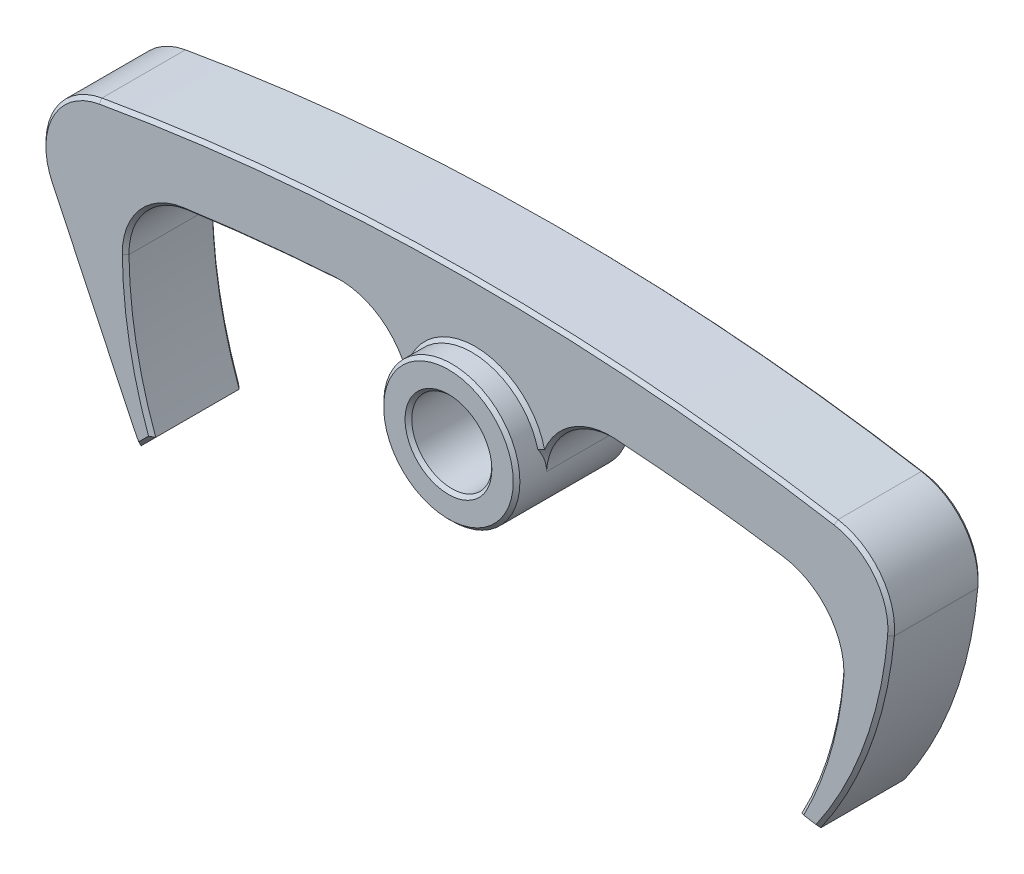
ISO-10303-21;
HEADER;
FILE_DESCRIPTION(('STEP AP214'),'2;1');
FILE_NAME('part.step','',(''),(''),'','','');
FILE_SCHEMA(('AUTOMOTIVE_DESIGN { 1 0 10303 214 1 1 1 1 }'));
ENDSEC;
DATA;
#1=APPLICATION_CONTEXT('core data for automotive mechanical design processes');
#2=APPLICATION_PROTOCOL_DEFINITION('international standard','automotive_design',2000,#1);
#3=PRODUCT_CONTEXT('',#1,'mechanical');
#4=PRODUCT('Part','Part','',(#3));
#5=PRODUCT_RELATED_PRODUCT_CATEGORY('part','',(#4));
#6=PRODUCT_DEFINITION_FORMATION('','',#4);
#7=PRODUCT_DEFINITION_CONTEXT('part definition',#1,'design');
#8=PRODUCT_DEFINITION('design','',#6,#7);
#9=PRODUCT_DEFINITION_SHAPE('','',#8);
#10=(LENGTH_UNIT() NAMED_UNIT(*) SI_UNIT(.MILLI.,.METRE.));
#11=(NAMED_UNIT(*) PLANE_ANGLE_UNIT() SI_UNIT($,.RADIAN.));
#12=(NAMED_UNIT(*) SI_UNIT($,.STERADIAN.) SOLID_ANGLE_UNIT());
#13=UNCERTAINTY_MEASURE_WITH_UNIT(LENGTH_MEASURE(1.E-05),#10,'distance_accuracy_value','');
#14=(GEOMETRIC_REPRESENTATION_CONTEXT(3) GLOBAL_UNCERTAINTY_ASSIGNED_CONTEXT((#13)) GLOBAL_UNIT_ASSIGNED_CONTEXT((#10,
#11,#12)) REPRESENTATION_CONTEXT('',''));
#15=CARTESIAN_POINT('',(0.,0.,0.));
#16=DIRECTION('',(0.,0.,1.));
#17=DIRECTION('',(1.,0.,0.));
#18=AXIS2_PLACEMENT_3D('',#15,#16,#17);
#19=CARTESIAN_POINT('',(26.0826309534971,-7.25582857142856,6.75));
#20=DIRECTION('',(0.,0.,-1.));
#21=DIRECTION('',(-1.,0.,0.));
#22=AXIS2_PLACEMENT_3D('',#19,#20,#21);
#23=PLANE('',#22);
#24=CARTESIAN_POINT('',(0.,-9.705,6.75));
#25=DIRECTION('',(0.,0.,-1.));
#26=DIRECTION('',(-1.,0.,0.));
#27=AXIS2_PLACEMENT_3D('',#24,#25,#26);
#28=CIRCLE('',#27,28.56);
#29=CARTESIAN_POINT('',(-25.810067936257,-21.9325914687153,6.75));
#30=VERTEX_POINT('',#29);
#31=CARTESIAN_POINT('',(-25.2021760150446,-23.1409191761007,6.75));
#32=VERTEX_POINT('',#31);
#33=EDGE_CURVE('E52',#30,#32,#28,.F.);
#34=ORIENTED_EDGE('',*,*,#33,.T.);
#35=DIRECTION('',(0.707106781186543,0.707106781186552,0.));
#36=VECTOR('',#35,1.);
#37=CARTESIAN_POINT('',(8.38277277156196,10.4440296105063,6.75));
#38=LINE('',#37,#36);
#39=CARTESIAN_POINT('',(-24.4678228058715,-22.4065659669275,6.75));
#40=VERTEX_POINT('',#39);
#41=EDGE_CURVE('E421',#32,#40,#38,.T.);
#42=ORIENTED_EDGE('',*,*,#41,.T.);
#43=CARTESIAN_POINT('',(6.668,-11.174,6.75));
#44=DIRECTION('',(0.,0.,-1.));
#45=DIRECTION('',(-1.,0.,0.));
#46=AXIS2_PLACEMENT_3D('',#43,#44,#45);
#47=CIRCLE('',#46,33.1000000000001);
#48=CARTESIAN_POINT('',(-26.4290066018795,-11.619144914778,6.75));
#49=VERTEX_POINT('',#48);
#50=EDGE_CURVE('E300',#40,#49,#47,.T.);
#51=ORIENTED_EDGE('',*,*,#50,.T.);
#52=CARTESIAN_POINT('',(-21.0994886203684,-11.5474644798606,6.75));
#53=DIRECTION('',(0.,0.,-1.));
#54=DIRECTION('',(-1.,0.,0.));
#55=AXIS2_PLACEMENT_3D('',#52,#53,#54);
#56=CIRCLE('',#55,5.33000000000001);
#57=CARTESIAN_POINT('',(-21.8373201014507,-6.26878048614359,6.75));
#58=VERTEX_POINT('',#57);
#59=EDGE_CURVE('E296',#49,#58,#56,.T.);
#60=ORIENTED_EDGE('',*,*,#59,.T.);
#61=CARTESIAN_POINT('',(0.,-162.5,6.75));
#62=DIRECTION('',(0.,0.,-1.));
#63=DIRECTION('',(-1.,0.,0.));
#64=AXIS2_PLACEMENT_3D('',#61,#62,#63);
#65=CIRCLE('',#64,157.75);
#66=CARTESIAN_POINT('',(-10.5100640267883,-5.10050491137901,6.75));
#67=VERTEX_POINT('',#66);
#68=EDGE_CURVE('E298',#58,#67,#65,.T.);
#69=ORIENTED_EDGE('',*,*,#68,.T.);
#70=CARTESIAN_POINT('',(-10.1549537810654,-10.4186621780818,6.75));
#71=DIRECTION('',(0.,0.,-1.));
#72=DIRECTION('',(-1.,0.,0.));
#73=AXIS2_PLACEMENT_3D('',#70,#71,#72);
#74=CIRCLE('',#73,5.33000000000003);
#75=CARTESIAN_POINT('',(-5.20114479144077,-8.4517670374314,6.75));
#76=VERTEX_POINT('',#75);
#77=EDGE_CURVE('E302',#67,#76,#74,.T.);
#78=ORIENTED_EDGE('',*,*,#77,.T.);
#79=CARTESIAN_POINT('',(0.,-9.705,6.75));
#80=DIRECTION('',(0.,0.,-1.));
#81=DIRECTION('',(-1.,0.,0.));
#82=AXIS2_PLACEMENT_3D('',#79,#80,#81);
#83=CIRCLE('',#82,5.34999999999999);
#84=CARTESIAN_POINT('',(5.20114479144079,-8.45176703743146,6.75));
#85=VERTEX_POINT('',#84);
#86=EDGE_CURVE('E269',#76,#85,#83,.T.);
#87=ORIENTED_EDGE('',*,*,#86,.T.);
#88=CARTESIAN_POINT('',(10.1549537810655,-10.4186621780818,6.75));
#89=DIRECTION('',(0.,0.,-1.));
#90=DIRECTION('',(-1.,0.,0.));
#91=AXIS2_PLACEMENT_3D('',#88,#89,#90);
#92=CIRCLE('',#91,5.32999999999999);
#93=CARTESIAN_POINT('',(10.5100640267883,-5.10050491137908,6.75));
#94=VERTEX_POINT('',#93);
#95=EDGE_CURVE('E262',#85,#94,#92,.T.);
#96=ORIENTED_EDGE('',*,*,#95,.T.);
#97=CARTESIAN_POINT('',(0.,-162.5,6.75));
#98=DIRECTION('',(0.,0.,-1.));
#99=DIRECTION('',(-1.,0.,0.));
#100=AXIS2_PLACEMENT_3D('',#97,#98,#99);
#101=CIRCLE('',#100,157.75);
#102=CARTESIAN_POINT('',(23.0686715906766,-6.44584628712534,6.75));
#103=VERTEX_POINT('',#102);
#104=EDGE_CURVE('E265',#94,#103,#101,.T.);
#105=ORIENTED_EDGE('',*,*,#104,.T.);
#106=CARTESIAN_POINT('',(22.289235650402,-11.7185476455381,6.75));
#107=DIRECTION('',(0.,0.,-1.));
#108=DIRECTION('',(-1.,0.,0.));
#109=AXIS2_PLACEMENT_3D('',#106,#107,#108);
#110=CIRCLE('',#109,5.32999999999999);
#111=CARTESIAN_POINT('',(27.5976192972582,-12.1980922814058,6.75));
#112=VERTEX_POINT('',#111);
#113=EDGE_CURVE('E288',#103,#112,#110,.T.);
#114=ORIENTED_EDGE('',*,*,#113,.T.);
#115=CARTESIAN_POINT('',(0.,-9.705,6.75));
#116=DIRECTION('',(0.,0.,-1.));
#117=DIRECTION('',(-1.,0.,0.));
#118=AXIS2_PLACEMENT_3D('',#115,#116,#117);
#119=CIRCLE('',#118,27.7100000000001);
#120=CARTESIAN_POINT('',(24.6036894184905,-22.4526494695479,6.75));
#121=VERTEX_POINT('',#120);
#122=EDGE_CURVE('E290',#112,#121,#119,.T.);
#123=ORIENTED_EDGE('',*,*,#122,.T.);
#124=DIRECTION('',(0.987136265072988,-0.159881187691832,0.));
#125=VECTOR('',#124,1.);
#126=CARTESIAN_POINT('',(23.6463953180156,-22.2976016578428,6.75));
#127=LINE('',#126,#125);
#128=CARTESIAN_POINT('',(25.5297338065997,-22.6026359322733,6.75));
#129=VERTEX_POINT('',#128);
#130=EDGE_CURVE('E661',#121,#129,#127,.T.);
#131=ORIENTED_EDGE('',*,*,#130,.T.);
#132=CARTESIAN_POINT('',(0.,-5.,6.75));
#133=DIRECTION('',(0.,0.,-1.));
#134=DIRECTION('',(-1.,0.,0.));
#135=AXIS2_PLACEMENT_3D('',#132,#133,#134);
#136=CIRCLE('',#135,31.01);
#137=CARTESIAN_POINT('',(30.8946671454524,-7.67201084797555,6.75));
#138=VERTEX_POINT('',#137);
#139=EDGE_CURVE('E663',#129,#138,#136,.F.);
#140=ORIENTED_EDGE('',*,*,#139,.T.);
#141=CARTESIAN_POINT('',(26.0826309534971,-7.25582857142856,6.75));
#142=DIRECTION('',(0.,0.,-1.));
#143=DIRECTION('',(-1.,0.,0.));
#144=AXIS2_PLACEMENT_3D('',#141,#142,#143);
#145=CIRCLE('',#144,4.83);
#146=CARTESIAN_POINT('',(26.8829047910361,-2.49258789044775,6.75));
#147=VERTEX_POINT('',#146);
#148=EDGE_CURVE('E665',#138,#147,#145,.F.);
#149=ORIENTED_EDGE('',*,*,#148,.T.);
#150=CARTESIAN_POINT('',(0.,-162.5,6.75));
#151=DIRECTION('',(0.,0.,-1.));
#152=DIRECTION('',(-1.,0.,0.));
#153=AXIS2_PLACEMENT_3D('',#150,#151,#152);
#154=CIRCLE('',#153,162.25);
#155=CARTESIAN_POINT('',(-28.1560691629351,-2.7117079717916,6.75));
#156=VERTEX_POINT('',#155);
#157=EDGE_CURVE('E667',#147,#156,#154,.F.);
#158=ORIENTED_EDGE('',*,*,#157,.T.);
#159=CARTESIAN_POINT('',(-27.3178946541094,-7.4684256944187,6.75));
#160=DIRECTION('',(0.,0.,-1.));
#161=DIRECTION('',(-1.,0.,0.));
#162=AXIS2_PLACEMENT_3D('',#159,#160,#161);
#163=CIRCLE('',#162,4.83);
#164=CARTESIAN_POINT('',(-31.6828326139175,-9.53632719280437,6.75));
#165=VERTEX_POINT('',#164);
#166=EDGE_CURVE('E669',#156,#165,#163,.F.);
#167=ORIENTED_EDGE('',*,*,#166,.T.);
#168=DIRECTION('',(0.428136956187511,-0.90371386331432,0.));
#169=VECTOR('',#168,1.);
#170=CARTESIAN_POINT('',(-21.9767060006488,-30.0240731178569,6.75));
#171=LINE('',#170,#169);
#172=EDGE_CURVE('E57',#165,#30,#171,.T.);
#173=ORIENTED_EDGE('',*,*,#172,.T.);
#174=EDGE_LOOP('',(#34,#42,#51,#60,#69,#78,#87,#96,#105,#114,#123,#131,#140,#149,#158,#167,#173));
#175=FACE_BOUND('',#174,.T.);
#176=ADVANCED_FACE('F30',(#175),#23,.F.);
#177=CARTESIAN_POINT('',(26.0826309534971,-7.25582857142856,0.));
#178=DIRECTION('',(0.,0.,-1.));
#179=DIRECTION('',(-1.,0.,0.));
#180=AXIS2_PLACEMENT_3D('',#177,#178,#179);
#181=PLANE('',#180);
#182=CARTESIAN_POINT('',(-27.3178946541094,-7.4684256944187,0.));
#183=DIRECTION('',(0.,0.,-1.));
#184=DIRECTION('',(-1.,0.,0.));
#185=AXIS2_PLACEMENT_3D('',#182,#183,#184);
#186=CIRCLE('',#185,4.83);
#187=CARTESIAN_POINT('',(-31.6828326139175,-9.53632719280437,0.));
#188=VERTEX_POINT('',#187);
#189=CARTESIAN_POINT('',(-28.1560691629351,-2.71170797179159,0.));
#190=VERTEX_POINT('',#189);
#191=EDGE_CURVE('E591',#188,#190,#186,.T.);
#192=ORIENTED_EDGE('',*,*,#191,.T.);
#193=CARTESIAN_POINT('',(0.,-162.5,0.));
#194=DIRECTION('',(0.,0.,-1.));
#195=DIRECTION('',(-1.,0.,0.));
#196=AXIS2_PLACEMENT_3D('',#193,#194,#195);
#197=CIRCLE('',#196,162.25);
#198=CARTESIAN_POINT('',(26.8829047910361,-2.49258789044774,0.));
#199=VERTEX_POINT('',#198);
#200=EDGE_CURVE('E593',#190,#199,#197,.T.);
#201=ORIENTED_EDGE('',*,*,#200,.T.);
#202=CARTESIAN_POINT('',(26.0826309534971,-7.25582857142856,0.));
#203=DIRECTION('',(0.,0.,-1.));
#204=DIRECTION('',(-1.,0.,0.));
#205=AXIS2_PLACEMENT_3D('',#202,#203,#204);
#206=CIRCLE('',#205,4.83000000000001);
#207=CARTESIAN_POINT('',(30.8946671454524,-7.67201084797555,0.));
#208=VERTEX_POINT('',#207);
#209=EDGE_CURVE('E561',#199,#208,#206,.T.);
#210=ORIENTED_EDGE('',*,*,#209,.T.);
#211=CARTESIAN_POINT('',(0.,-5.,0.));
#212=DIRECTION('',(0.,0.,-1.));
#213=DIRECTION('',(-1.,0.,0.));
#214=AXIS2_PLACEMENT_3D('',#211,#212,#213);
#215=CIRCLE('',#214,31.01);
#216=CARTESIAN_POINT('',(25.5297338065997,-22.6026359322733,0.));
#217=VERTEX_POINT('',#216);
#218=EDGE_CURVE('E563',#208,#217,#215,.T.);
#219=ORIENTED_EDGE('',*,*,#218,.T.);
#220=DIRECTION('',(-0.987136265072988,0.159881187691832,0.));
#221=VECTOR('',#220,1.);
#222=CARTESIAN_POINT('',(24.2605708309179,-22.3970763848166,0.));
#223=LINE('',#222,#221);
#224=CARTESIAN_POINT('',(24.6036894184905,-22.4526494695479,0.));
#225=VERTEX_POINT('',#224);
#226=EDGE_CURVE('E565',#217,#225,#223,.T.);
#227=ORIENTED_EDGE('',*,*,#226,.T.);
#228=CARTESIAN_POINT('',(0.,-9.705,0.));
#229=DIRECTION('',(0.,0.,-1.));
#230=DIRECTION('',(-1.,0.,0.));
#231=AXIS2_PLACEMENT_3D('',#228,#229,#230);
#232=CIRCLE('',#231,27.7100000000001);
#233=CARTESIAN_POINT('',(27.5976192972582,-12.1980922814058,0.));
#234=VERTEX_POINT('',#233);
#235=EDGE_CURVE('E567',#225,#234,#232,.F.);
#236=ORIENTED_EDGE('',*,*,#235,.T.);
#237=CARTESIAN_POINT('',(22.289235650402,-11.7185476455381,0.));
#238=DIRECTION('',(0.,0.,-1.));
#239=DIRECTION('',(-1.,0.,0.));
#240=AXIS2_PLACEMENT_3D('',#237,#238,#239);
#241=CIRCLE('',#240,5.32999999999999);
#242=CARTESIAN_POINT('',(23.0686715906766,-6.44584628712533,0.));
#243=VERTEX_POINT('',#242);
#244=EDGE_CURVE('E569',#234,#243,#241,.F.);
#245=ORIENTED_EDGE('',*,*,#244,.T.);
#246=CARTESIAN_POINT('',(0.,-162.5,0.));
#247=DIRECTION('',(0.,0.,-1.));
#248=DIRECTION('',(-1.,0.,0.));
#249=AXIS2_PLACEMENT_3D('',#246,#247,#248);
#250=CIRCLE('',#249,157.75);
#251=CARTESIAN_POINT('',(10.5100640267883,-5.10050491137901,0.));
#252=VERTEX_POINT('',#251);
#253=EDGE_CURVE('E571',#243,#252,#250,.F.);
#254=ORIENTED_EDGE('',*,*,#253,.T.);
#255=CARTESIAN_POINT('',(10.1549537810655,-10.4186621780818,0.));
#256=DIRECTION('',(0.,0.,-1.));
#257=DIRECTION('',(-1.,0.,0.));
#258=AXIS2_PLACEMENT_3D('',#255,#256,#257);
#259=CIRCLE('',#258,5.32999999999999);
#260=CARTESIAN_POINT('',(4.8380673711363,-10.0450060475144,0.));
#261=VERTEX_POINT('',#260);
#262=EDGE_CURVE('E573',#252,#261,#259,.F.);
#263=ORIENTED_EDGE('',*,*,#262,.T.);
#264=CARTESIAN_POINT('',(0.,-9.705,0.));
#265=DIRECTION('',(0.,0.,-1.));
#266=DIRECTION('',(-1.,0.,0.));
#267=AXIS2_PLACEMENT_3D('',#264,#265,#266);
#268=CIRCLE('',#267,4.85);
#269=CARTESIAN_POINT('',(-4.8380673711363,-10.0450060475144,0.));
#270=VERTEX_POINT('',#269);
#271=EDGE_CURVE('E575',#261,#270,#268,.T.);
#272=ORIENTED_EDGE('',*,*,#271,.T.);
#273=CARTESIAN_POINT('',(-10.1549537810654,-10.4186621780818,0.));
#274=DIRECTION('',(0.,0.,-1.));
#275=DIRECTION('',(-1.,0.,0.));
#276=AXIS2_PLACEMENT_3D('',#273,#274,#275);
#277=CIRCLE('',#276,5.33000000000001);
#278=CARTESIAN_POINT('',(-10.5100640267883,-5.10050491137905,0.));
#279=VERTEX_POINT('',#278);
#280=EDGE_CURVE('E577',#270,#279,#277,.F.);
#281=ORIENTED_EDGE('',*,*,#280,.T.);
#282=CARTESIAN_POINT('',(0.,-162.5,0.));
#283=DIRECTION('',(0.,0.,-1.));
#284=DIRECTION('',(-1.,0.,0.));
#285=AXIS2_PLACEMENT_3D('',#282,#283,#284);
#286=CIRCLE('',#285,157.75);
#287=CARTESIAN_POINT('',(-21.8373201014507,-6.2687804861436,0.));
#288=VERTEX_POINT('',#287);
#289=EDGE_CURVE('E579',#279,#288,#286,.F.);
#290=ORIENTED_EDGE('',*,*,#289,.T.);
#291=CARTESIAN_POINT('',(-21.0994886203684,-11.5474644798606,0.));
#292=DIRECTION('',(0.,0.,-1.));
#293=DIRECTION('',(-1.,0.,0.));
#294=AXIS2_PLACEMENT_3D('',#291,#292,#293);
#295=CIRCLE('',#294,5.32999999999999);
#296=CARTESIAN_POINT('',(-26.4290066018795,-11.619144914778,0.));
#297=VERTEX_POINT('',#296);
#298=EDGE_CURVE('E581',#288,#297,#295,.F.);
#299=ORIENTED_EDGE('',*,*,#298,.T.);
#300=CARTESIAN_POINT('',(6.668,-11.174,0.));
#301=DIRECTION('',(0.,0.,-1.));
#302=DIRECTION('',(-1.,0.,0.));
#303=AXIS2_PLACEMENT_3D('',#300,#301,#302);
#304=CIRCLE('',#303,33.1);
#305=CARTESIAN_POINT('',(-24.4678228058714,-22.4065659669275,0.));
#306=VERTEX_POINT('',#305);
#307=EDGE_CURVE('E583',#297,#306,#304,.F.);
#308=ORIENTED_EDGE('',*,*,#307,.T.);
#309=DIRECTION('',(-0.707106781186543,-0.707106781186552,0.));
#310=VECTOR('',#309,1.);
#311=CARTESIAN_POINT('',(-25.4393448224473,-23.3780879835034,0.));
#312=LINE('',#311,#310);
#313=CARTESIAN_POINT('',(-25.2021760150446,-23.1409191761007,0.));
#314=VERTEX_POINT('',#313);
#315=EDGE_CURVE('E585',#306,#314,#312,.T.);
#316=ORIENTED_EDGE('',*,*,#315,.T.);
#317=CARTESIAN_POINT('',(0.,-9.705,0.));
#318=DIRECTION('',(0.,0.,-1.));
#319=DIRECTION('',(-1.,0.,0.));
#320=AXIS2_PLACEMENT_3D('',#317,#318,#319);
#321=CIRCLE('',#320,28.56);
#322=CARTESIAN_POINT('',(-25.810067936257,-21.9325914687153,0.));
#323=VERTEX_POINT('',#322);
#324=EDGE_CURVE('E587',#314,#323,#321,.T.);
#325=ORIENTED_EDGE('',*,*,#324,.T.);
#326=DIRECTION('',(-0.428136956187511,0.90371386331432,0.));
#327=VECTOR('',#326,1.);
#328=CARTESIAN_POINT('',(-31.6828326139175,-9.53632719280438,0.));
#329=LINE('',#328,#327);
#330=EDGE_CURVE('E589',#323,#188,#329,.T.);
#331=ORIENTED_EDGE('',*,*,#330,.T.);
#332=EDGE_LOOP('',(#192,#201,#210,#219,#227,#236,#245,#254,#263,#272,#281,#290,#299,#308,#316,
#325,#331));
#333=FACE_BOUND('',#332,.T.);
#334=CARTESIAN_POINT('',(0.,-9.705,0.));
#335=DIRECTION('',(0.,0.,-1.));
#336=DIRECTION('',(-1.,0.,0.));
#337=AXIS2_PLACEMENT_3D('',#334,#335,#336);
#338=CIRCLE('',#337,3.25);
#339=CARTESIAN_POINT('',(-3.25,-9.705,0.));
#340=VERTEX_POINT('',#339);
#341=EDGE_CURVE('E558',#340,#340,#338,.F.);
#342=ORIENTED_EDGE('',*,*,#341,.T.);
#343=EDGE_LOOP('',(#342));
#344=FACE_BOUND('',#343,.T.);
#345=ADVANCED_FACE('F802',(#333,#344),#181,.T.);
#346=CARTESIAN_POINT('',(26.0826309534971,-7.25582857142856,6.75));
#347=DIRECTION('',(0.,0.,-1.));
#348=DIRECTION('',(-1.,0.,0.));
#349=AXIS2_PLACEMENT_3D('',#346,#347,#348);
#350=CYLINDRICAL_SURFACE('',#349,5.08);
#351=DIRECTION('',(0.,0.,-1.));
#352=VECTOR('',#351,1.);
#353=CARTESIAN_POINT('',(31.1437373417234,-7.69355237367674,6.75));
#354=LINE('',#353,#352);
#355=CARTESIAN_POINT('',(31.1437373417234,-7.69355237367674,6.50000000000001));
#356=VERTEX_POINT('',#355);
#357=CARTESIAN_POINT('',(31.1437373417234,-7.69355237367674,0.249999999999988));
#358=VERTEX_POINT('',#357);
#359=EDGE_CURVE('E682',#356,#358,#354,.T.);
#360=ORIENTED_EDGE('',*,*,#359,.T.);
#361=CARTESIAN_POINT('',(26.0826309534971,-7.25582857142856,0.249999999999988));
#362=DIRECTION('',(0.,0.,-1.));
#363=DIRECTION('',(-1.,0.,0.));
#364=AXIS2_PLACEMENT_3D('',#361,#362,#363);
#365=CIRCLE('',#364,5.08);
#366=CARTESIAN_POINT('',(26.9243268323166,-2.24604334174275,0.249999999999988));
#367=VERTEX_POINT('',#366);
#368=EDGE_CURVE('E646',#358,#367,#365,.F.);
#369=ORIENTED_EDGE('',*,*,#368,.T.);
#370=DIRECTION('',(0.,0.,-1.));
#371=VECTOR('',#370,1.);
#372=CARTESIAN_POINT('',(26.9243268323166,-2.24604334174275,6.75));
#373=LINE('',#372,#371);
#374=CARTESIAN_POINT('',(26.9243268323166,-2.24604334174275,6.50000000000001));
#375=VERTEX_POINT('',#374);
#376=EDGE_CURVE('E272',#375,#367,#373,.T.);
#377=ORIENTED_EDGE('',*,*,#376,.F.);
#378=CARTESIAN_POINT('',(26.0826309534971,-7.25582857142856,6.50000000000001));
#379=DIRECTION('',(0.,0.,-1.));
#380=DIRECTION('',(-1.,0.,0.));
#381=AXIS2_PLACEMENT_3D('',#378,#379,#380);
#382=CIRCLE('',#381,5.08);
#383=EDGE_CURVE('E644',#375,#356,#382,.T.);
#384=ORIENTED_EDGE('',*,*,#383,.T.);
#385=EDGE_LOOP('',(#360,#369,#377,#384));
#386=FACE_BOUND('',#385,.T.);
#387=ADVANCED_FACE('F348',(#386),#350,.T.);
#388=CARTESIAN_POINT('',(0.,-162.5,6.75));
#389=DIRECTION('',(0.,0.,-1.));
#390=DIRECTION('',(-1.,0.,0.));
#391=AXIS2_PLACEMENT_3D('',#388,#389,#390);
#392=CYLINDRICAL_SURFACE('',#391,162.5);
#393=ORIENTED_EDGE('',*,*,#376,.T.);
#394=CARTESIAN_POINT('',(0.,-162.5,0.249999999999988));
#395=DIRECTION('',(0.,0.,-1.));
#396=DIRECTION('',(-1.,0.,0.));
#397=AXIS2_PLACEMENT_3D('',#394,#395,#396);
#398=CIRCLE('',#397,162.5);
#399=CARTESIAN_POINT('',(-28.1994529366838,-2.46550105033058,0.249999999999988));
#400=VERTEX_POINT('',#399);
#401=EDGE_CURVE('E555',#367,#400,#398,.F.);
#402=ORIENTED_EDGE('',*,*,#401,.T.);
#403=DIRECTION('',(0.,0.,-1.));
#404=VECTOR('',#403,1.);
#405=CARTESIAN_POINT('',(-28.1994529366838,-2.46550105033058,6.75));
#406=LINE('',#405,#404);
#407=CARTESIAN_POINT('',(-28.1994529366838,-2.46550105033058,6.50000000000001));
#408=VERTEX_POINT('',#407);
#409=EDGE_CURVE('E755',#408,#400,#406,.T.);
#410=ORIENTED_EDGE('',*,*,#409,.F.);
#411=CARTESIAN_POINT('',(0.,-162.5,6.50000000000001));
#412=DIRECTION('',(0.,0.,-1.));
#413=DIRECTION('',(-1.,0.,0.));
#414=AXIS2_PLACEMENT_3D('',#411,#412,#413);
#415=CIRCLE('',#414,162.5);
#416=EDGE_CURVE('E553',#408,#375,#415,.T.);
#417=ORIENTED_EDGE('',*,*,#416,.T.);
#418=EDGE_LOOP('',(#393,#402,#410,#417));
#419=FACE_BOUND('',#418,.T.);
#420=ADVANCED_FACE('F763',(#419),#392,.T.);
#421=CARTESIAN_POINT('',(-27.3178946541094,-7.4684256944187,6.75));
#422=DIRECTION('',(0.,0.,-1.));
#423=DIRECTION('',(-1.,0.,0.));
#424=AXIS2_PLACEMENT_3D('',#421,#422,#423);
#425=CYLINDRICAL_SURFACE('',#424,5.07999999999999);
#426=ORIENTED_EDGE('',*,*,#409,.T.);
#427=CARTESIAN_POINT('',(-27.3178946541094,-7.4684256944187,0.249999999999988));
#428=DIRECTION('',(0.,0.,-1.));
#429=DIRECTION('',(-1.,0.,0.));
#430=AXIS2_PLACEMENT_3D('',#427,#428,#429);
#431=CIRCLE('',#430,5.07999999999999);
#432=CARTESIAN_POINT('',(-31.9087610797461,-9.64336143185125,0.249999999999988));
#433=VERTEX_POINT('',#432);
#434=EDGE_CURVE('E598',#400,#433,#431,.F.);
#435=ORIENTED_EDGE('',*,*,#434,.T.);
#436=DIRECTION('',(0.,0.,-1.));
#437=VECTOR('',#436,1.);
#438=CARTESIAN_POINT('',(-31.9087610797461,-9.64336143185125,6.75));
#439=LINE('',#438,#437);
#440=CARTESIAN_POINT('',(-31.9087610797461,-9.64336143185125,6.50000000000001));
#441=VERTEX_POINT('',#440);
#442=EDGE_CURVE('E753',#441,#433,#439,.T.);
#443=ORIENTED_EDGE('',*,*,#442,.F.);
#444=CARTESIAN_POINT('',(-27.3178946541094,-7.4684256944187,6.50000000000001));
#445=DIRECTION('',(0.,0.,-1.));
#446=DIRECTION('',(-1.,0.,0.));
#447=AXIS2_PLACEMENT_3D('',#444,#445,#446);
#448=CIRCLE('',#447,5.07999999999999);
#449=EDGE_CURVE('E596',#441,#408,#448,.T.);
#450=ORIENTED_EDGE('',*,*,#449,.T.);
#451=EDGE_LOOP('',(#426,#435,#443,#450));
#452=FACE_BOUND('',#451,.T.);
#453=ADVANCED_FACE('F782',(#452),#425,.T.);
#454=CARTESIAN_POINT('',(-31.9087610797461,-9.64336143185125,6.75));
#455=DIRECTION('',(0.90371386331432,0.428136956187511,0.));
#456=DIRECTION('',(-0.428136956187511,0.90371386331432,0.));
#457=AXIS2_PLACEMENT_3D('',#454,#455,#456);
#458=PLANE('',#457);
#459=ORIENTED_EDGE('',*,*,#442,.T.);
#460=DIRECTION('',(0.428136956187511,-0.90371386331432,0.));
#461=VECTOR('',#460,1.);
#462=CARTESIAN_POINT('',(-26.0359964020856,-22.0396257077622,0.249999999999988));
#463=LINE('',#462,#461);
#464=CARTESIAN_POINT('',(-26.0359964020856,-22.0396257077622,0.249999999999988));
#465=VERTEX_POINT('',#464);
#466=EDGE_CURVE('E602',#433,#465,#463,.T.);
#467=ORIENTED_EDGE('',*,*,#466,.T.);
#468=DIRECTION('',(0.,0.,-1.));
#469=VECTOR('',#468,1.);
#470=CARTESIAN_POINT('',(-26.0359964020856,-22.0396257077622,6.75));
#471=LINE('',#470,#469);
#472=CARTESIAN_POINT('',(-26.0359964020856,-22.0396257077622,6.50000000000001));
#473=VERTEX_POINT('',#472);
#474=EDGE_CURVE('E750',#473,#465,#471,.T.);
#475=ORIENTED_EDGE('',*,*,#474,.F.);
#476=DIRECTION('',(-0.428136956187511,0.90371386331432,0.));
#477=VECTOR('',#476,1.);
#478=CARTESIAN_POINT('',(-31.9087610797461,-9.64336143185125,6.50000000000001));
#479=LINE('',#478,#477);
#480=EDGE_CURVE('E600',#473,#441,#479,.T.);
#481=ORIENTED_EDGE('',*,*,#480,.T.);
#482=EDGE_LOOP('',(#459,#467,#475,#481));
#483=FACE_BOUND('',#482,.T.);
#484=ADVANCED_FACE('F786',(#483),#458,.F.);
#485=CARTESIAN_POINT('',(0.,-9.705,6.75));
#486=DIRECTION('',(0.,0.,-1.));
#487=DIRECTION('',(-1.,0.,0.));
#488=AXIS2_PLACEMENT_3D('',#485,#486,#487);
#489=CYLINDRICAL_SURFACE('',#488,28.81);
#490=ORIENTED_EDGE('',*,*,#474,.T.);
#491=CARTESIAN_POINT('',(0.,-9.705,0.249999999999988));
#492=DIRECTION('',(0.,0.,-1.));
#493=DIRECTION('',(-1.,0.,0.));
#494=AXIS2_PLACEMENT_3D('',#491,#492,#493);
#495=CIRCLE('',#494,28.81);
#496=CARTESIAN_POINT('',(-25.2625681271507,-23.5548646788,0.249999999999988));
#497=VERTEX_POINT('',#496);
#498=EDGE_CURVE('E606',#465,#497,#495,.F.);
#499=ORIENTED_EDGE('',*,*,#498,.T.);
#500=DIRECTION('',(0.,0.,-1.));
#501=VECTOR('',#500,1.);
#502=CARTESIAN_POINT('',(-25.2625681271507,-23.5548646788,6.75));
#503=LINE('',#502,#501);
#504=CARTESIAN_POINT('',(-25.2625681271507,-23.5548646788,6.50000000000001));
#505=VERTEX_POINT('',#504);
#506=EDGE_CURVE('E747',#505,#497,#503,.T.);
#507=ORIENTED_EDGE('',*,*,#506,.F.);
#508=CARTESIAN_POINT('',(0.,-9.705,6.50000000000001));
#509=DIRECTION('',(0.,0.,-1.));
#510=DIRECTION('',(-1.,0.,0.));
#511=AXIS2_PLACEMENT_3D('',#508,#509,#510);
#512=CIRCLE('',#511,28.81);
#513=EDGE_CURVE('E604',#505,#473,#512,.T.);
#514=ORIENTED_EDGE('',*,*,#513,.T.);
#515=EDGE_LOOP('',(#490,#499,#507,#514));
#516=FACE_BOUND('',#515,.T.);
#517=ADVANCED_FACE('F1099',(#516),#489,.T.);
#518=CARTESIAN_POINT('',(-25.2625681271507,-23.5548646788,6.75));
#519=DIRECTION('',(-0.707106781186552,0.707106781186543,0.));
#520=DIRECTION('',(-0.707106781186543,-0.707106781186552,0.));
#521=AXIS2_PLACEMENT_3D('',#518,#519,#520);
#522=PLANE('',#521);
#523=ORIENTED_EDGE('',*,*,#506,.T.);
#524=DIRECTION('',(0.707106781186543,0.707106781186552,0.));
#525=VECTOR('',#524,1.);
#526=CARTESIAN_POINT('',(-24.1784801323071,-22.4707766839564,0.249999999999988));
#527=LINE('',#526,#525);
#528=CARTESIAN_POINT('',(-24.1784801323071,-22.4707766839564,0.249999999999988));
#529=VERTEX_POINT('',#528);
#530=EDGE_CURVE('E610',#497,#529,#527,.T.);
#531=ORIENTED_EDGE('',*,*,#530,.T.);
#532=DIRECTION('',(0.,0.,-1.));
#533=VECTOR('',#532,1.);
#534=CARTESIAN_POINT('',(-24.1784801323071,-22.4707766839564,6.75));
#535=LINE('',#534,#533);
#536=CARTESIAN_POINT('',(-24.1784801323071,-22.4707766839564,6.49999999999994));
#537=VERTEX_POINT('',#536);
#538=EDGE_CURVE('E744',#537,#529,#535,.T.);
#539=ORIENTED_EDGE('',*,*,#538,.F.);
#540=DIRECTION('',(-0.707106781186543,-0.707106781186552,0.));
#541=VECTOR('',#540,1.);
#542=CARTESIAN_POINT('',(-25.2625681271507,-23.5548646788,6.49999999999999));
#543=LINE('',#542,#541);
#544=EDGE_CURVE('E608',#537,#505,#543,.T.);
#545=ORIENTED_EDGE('',*,*,#544,.T.);
#546=EDGE_LOOP('',(#523,#531,#539,#545));
#547=FACE_BOUND('',#546,.T.);
#548=ADVANCED_FACE('F1101',(#547),#522,.F.);
#549=CARTESIAN_POINT('',(6.668,-11.174,6.75));
#550=DIRECTION('',(0.,0.,-1.));
#551=DIRECTION('',(-1.,0.,0.));
#552=AXIS2_PLACEMENT_3D('',#549,#550,#551);
#553=CYLINDRICAL_SURFACE('',#552,32.85);
#554=ORIENTED_EDGE('',*,*,#538,.T.);
#555=CARTESIAN_POINT('',(6.668,-11.174,0.249999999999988));
#556=DIRECTION('',(0.,0.,-1.));
#557=DIRECTION('',(-1.,0.,0.));
#558=AXIS2_PLACEMENT_3D('',#555,#556,#557);
#559=CIRCLE('',#558,32.85);
#560=CARTESIAN_POINT('',(-26.1790292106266,-11.6157827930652,0.249999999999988));
#561=VERTEX_POINT('',#560);
#562=EDGE_CURVE('E612',#529,#561,#559,.T.);
#563=ORIENTED_EDGE('',*,*,#562,.T.);
#564=DIRECTION('',(0.,0.,-1.));
#565=VECTOR('',#564,1.);
#566=CARTESIAN_POINT('',(-26.1790292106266,-11.6157827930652,6.75));
#567=LINE('',#566,#565);
#568=CARTESIAN_POINT('',(-26.1790292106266,-11.6157827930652,6.49999999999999));
#569=VERTEX_POINT('',#568);
#570=EDGE_CURVE('E741',#569,#561,#567,.T.);
#571=ORIENTED_EDGE('',*,*,#570,.F.);
#572=CARTESIAN_POINT('',(6.668,-11.174,6.49999999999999));
#573=DIRECTION('',(0.,0.,-1.));
#574=DIRECTION('',(-1.,0.,0.));
#575=AXIS2_PLACEMENT_3D('',#572,#573,#574);
#576=CIRCLE('',#575,32.85);
#577=EDGE_CURVE('E679',#569,#537,#576,.F.);
#578=ORIENTED_EDGE('',*,*,#577,.T.);
#579=EDGE_LOOP('',(#554,#563,#571,#578));
#580=FACE_BOUND('',#579,.T.);
#581=ADVANCED_FACE('F1103',(#580),#553,.F.);
#582=CARTESIAN_POINT('',(-21.0994886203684,-11.5474644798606,6.75));
#583=DIRECTION('',(0.,0.,-1.));
#584=DIRECTION('',(-1.,0.,0.));
#585=AXIS2_PLACEMENT_3D('',#582,#583,#584);
#586=CYLINDRICAL_SURFACE('',#585,5.08);
#587=ORIENTED_EDGE('',*,*,#570,.T.);
#588=CARTESIAN_POINT('',(-21.0994886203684,-11.5474644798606,0.249999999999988));
#589=DIRECTION('',(0.,0.,-1.));
#590=DIRECTION('',(-1.,0.,0.));
#591=AXIS2_PLACEMENT_3D('',#588,#589,#590);
#592=CIRCLE('',#591,5.08);
#593=CARTESIAN_POINT('',(-21.8027126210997,-6.51637354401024,0.249999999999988));
#594=VERTEX_POINT('',#593);
#595=EDGE_CURVE('E614',#561,#594,#592,.T.);
#596=ORIENTED_EDGE('',*,*,#595,.T.);
#597=DIRECTION('',(0.,0.,-1.));
#598=VECTOR('',#597,1.);
#599=CARTESIAN_POINT('',(-21.8027126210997,-6.51637354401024,6.75));
#600=LINE('',#599,#598);
#601=CARTESIAN_POINT('',(-21.8027126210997,-6.51637354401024,6.49999999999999));
#602=VERTEX_POINT('',#601);
#603=EDGE_CURVE('E738',#602,#594,#600,.T.);
#604=ORIENTED_EDGE('',*,*,#603,.F.);
#605=CARTESIAN_POINT('',(-21.0994886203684,-11.5474644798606,6.49999999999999));
#606=DIRECTION('',(0.,0.,-1.));
#607=DIRECTION('',(-1.,0.,0.));
#608=AXIS2_PLACEMENT_3D('',#605,#606,#607);
#609=CIRCLE('',#608,5.08);
#610=EDGE_CURVE('E1074',#602,#569,#609,.F.);
#611=ORIENTED_EDGE('',*,*,#610,.T.);
#612=EDGE_LOOP('',(#587,#596,#604,#611));
#613=FACE_BOUND('',#612,.T.);
#614=ADVANCED_FACE('F1105',(#613),#586,.F.);
#615=CARTESIAN_POINT('',(0.,-162.5,6.75));
#616=DIRECTION('',(0.,0.,-1.));
#617=DIRECTION('',(-1.,0.,0.));
#618=AXIS2_PLACEMENT_3D('',#615,#616,#617);
#619=CYLINDRICAL_SURFACE('',#618,157.5);
#620=ORIENTED_EDGE('',*,*,#603,.T.);
#621=CARTESIAN_POINT('',(0.,-162.5,0.249999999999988));
#622=DIRECTION('',(0.,0.,-1.));
#623=DIRECTION('',(-1.,0.,0.));
#624=AXIS2_PLACEMENT_3D('',#621,#622,#623);
#625=CIRCLE('',#624,157.5);
#626=CARTESIAN_POINT('',(-10.4934078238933,-5.34994943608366,0.249999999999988));
#627=VERTEX_POINT('',#626);
#628=EDGE_CURVE('E616',#594,#627,#625,.T.);
#629=ORIENTED_EDGE('',*,*,#628,.T.);
#630=DIRECTION('',(0.,0.,-1.));
#631=VECTOR('',#630,1.);
#632=CARTESIAN_POINT('',(-10.4934078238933,-5.34994943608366,6.75));
#633=LINE('',#632,#631);
#634=CARTESIAN_POINT('',(-10.4934078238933,-5.34994943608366,6.49999999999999));
#635=VERTEX_POINT('',#634);
#636=EDGE_CURVE('E309',#635,#627,#633,.T.);
#637=ORIENTED_EDGE('',*,*,#636,.F.);
#638=CARTESIAN_POINT('',(0.,-162.5,6.49999999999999));
#639=DIRECTION('',(0.,0.,-1.));
#640=DIRECTION('',(-1.,0.,0.));
#641=AXIS2_PLACEMENT_3D('',#638,#639,#640);
#642=CIRCLE('',#641,157.5);
#643=EDGE_CURVE('E692',#635,#602,#642,.F.);
#644=ORIENTED_EDGE('',*,*,#643,.T.);
#645=EDGE_LOOP('',(#620,#629,#637,#644));
#646=FACE_BOUND('',#645,.T.);
#647=ADVANCED_FACE('F853',(#646),#619,.F.);
#648=CARTESIAN_POINT('',(-10.1549537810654,-10.4186621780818,6.75));
#649=DIRECTION('',(0.,0.,-1.));
#650=DIRECTION('',(-1.,0.,0.));
#651=AXIS2_PLACEMENT_3D('',#648,#649,#650);
#652=CYLINDRICAL_SURFACE('',#651,5.08000000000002);
#653=ORIENTED_EDGE('',*,*,#636,.T.);
#654=CARTESIAN_POINT('',(-10.1549537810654,-10.4186621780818,0.249999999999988));
#655=DIRECTION('',(0.,0.,-1.));
#656=DIRECTION('',(-1.,0.,0.));
#657=AXIS2_PLACEMENT_3D('',#654,#655,#656);
#658=CIRCLE('',#657,5.08000000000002);
#659=CARTESIAN_POINT('',(-5.08745228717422,-10.0625321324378,0.249999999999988));
#660=VERTEX_POINT('',#659);
#661=EDGE_CURVE('E618',#627,#660,#658,.T.);
#662=ORIENTED_EDGE('',*,*,#661,.T.);
#663=DIRECTION('',(0.,0.,-1.));
#664=VECTOR('',#663,1.);
#665=CARTESIAN_POINT('',(-5.08745228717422,-10.0625321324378,6.75));
#666=LINE('',#665,#664);
#667=CARTESIAN_POINT('',(-5.08745228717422,-10.0625321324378,6.49999999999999));
#668=VERTEX_POINT('',#667);
#669=EDGE_CURVE('E305',#668,#660,#666,.T.);
#670=ORIENTED_EDGE('',*,*,#669,.F.);
#671=CARTESIAN_POINT('',(-10.1549537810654,-10.4186621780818,6.49999999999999));
#672=DIRECTION('',(0.,0.,-1.));
#673=DIRECTION('',(-1.,0.,0.));
#674=AXIS2_PLACEMENT_3D('',#671,#672,#673);
#675=CIRCLE('',#674,5.08000000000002);
#676=EDGE_CURVE('E304',#668,#635,#675,.F.);
#677=ORIENTED_EDGE('',*,*,#676,.T.);
#678=EDGE_LOOP('',(#653,#662,#670,#677));
#679=FACE_BOUND('',#678,.T.);
#680=ADVANCED_FACE('F848',(#679),#652,.F.);
#681=CARTESIAN_POINT('',(0.,-9.705,6.75));
#682=DIRECTION('',(0.,0.,-1.));
#683=DIRECTION('',(-1.,0.,0.));
#684=AXIS2_PLACEMENT_3D('',#681,#682,#683);
#685=CYLINDRICAL_SURFACE('',#684,5.1);
#686=CARTESIAN_POINT('',(0.,-9.705,8.49999999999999));
#687=DIRECTION('',(0.,0.,1.));
#688=DIRECTION('',(1.,0.,0.));
#689=AXIS2_PLACEMENT_3D('',#686,#687,#688);
#690=CIRCLE('',#689,5.1);
#691=CARTESIAN_POINT('',(5.1,-9.705,8.49999999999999));
#692=VERTEX_POINT('',#691);
#693=EDGE_CURVE('E620',#692,#692,#690,.F.);
#694=ORIENTED_EDGE('',*,*,#693,.T.);
#695=EDGE_LOOP('',(#694));
#696=FACE_BOUND('',#695,.T.);
#697=ORIENTED_EDGE('',*,*,#669,.T.);
#698=CARTESIAN_POINT('',(0.,-9.705,0.249999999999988));
#699=DIRECTION('',(0.,0.,-1.));
#700=DIRECTION('',(-1.,0.,0.));
#701=AXIS2_PLACEMENT_3D('',#698,#699,#700);
#702=CIRCLE('',#701,5.1);
#703=CARTESIAN_POINT('',(5.08745228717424,-10.0625321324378,0.249999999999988));
#704=VERTEX_POINT('',#703);
#705=EDGE_CURVE('E626',#660,#704,#702,.F.);
#706=ORIENTED_EDGE('',*,*,#705,.T.);
#707=DIRECTION('',(0.,0.,-1.));
#708=VECTOR('',#707,1.);
#709=CARTESIAN_POINT('',(5.08745228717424,-10.0625321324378,6.75));
#710=LINE('',#709,#708);
#711=CARTESIAN_POINT('',(5.08745228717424,-10.0625321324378,6.50000000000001));
#712=VERTEX_POINT('',#711);
#713=EDGE_CURVE('E310',#712,#704,#710,.T.);
#714=ORIENTED_EDGE('',*,*,#713,.F.);
#715=CARTESIAN_POINT('',(5.08745228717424,-10.0625321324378,6.50000000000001));
#716=CARTESIAN_POINT('',(5.09258234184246,-9.98975741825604,6.49995748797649));
#717=CARTESIAN_POINT('',(5.096118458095,-9.91689743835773,6.50313562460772));
#718=CARTESIAN_POINT('',(5.10007580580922,-9.77171099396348,6.51560421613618));
#719=CARTESIAN_POINT('',(5.10050119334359,-9.69938394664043,6.52488649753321));
#720=CARTESIAN_POINT('',(5.09833441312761,-9.55649746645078,6.54911261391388));
#721=CARTESIAN_POINT('',(5.09577278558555,-9.4859275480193,6.56399811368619));
#722=CARTESIAN_POINT('',(5.08784671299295,-9.34623691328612,6.59890729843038));
#723=CARTESIAN_POINT('',(5.08248178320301,-9.27711644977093,6.61893187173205));
#724=CARTESIAN_POINT('',(5.06627144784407,-9.11127977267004,6.67312679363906));
#725=CARTESIAN_POINT('',(5.0540616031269,-9.01547079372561,6.70967795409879));
#726=CARTESIAN_POINT('',(5.02636431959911,-8.83725623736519,6.7863085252));
#727=CARTESIAN_POINT('',(5.01132409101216,-8.75446576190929,6.82567461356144));
#728=CARTESIAN_POINT('',(4.97782250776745,-8.59229641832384,6.90937614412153));
#729=CARTESIAN_POINT('',(4.95936614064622,-8.51291278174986,6.95370430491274));
#730=CARTESIAN_POINT('',(4.93938541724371,-8.43516863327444,6.99999999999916));
#731=B_SPLINE_CURVE_WITH_KNOTS('',3,(#715,#716,#717,#718,#719,#720,#721,#722,#723,#724,#725,
#726,#727,#728,#729,#730),.UNSPECIFIED.,.F.,.F.,(4,2,2,2,2,2,2,4),(0.,0.218736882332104,
0.437181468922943,0.653412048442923,0.86968003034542,1.17889591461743,1.45733349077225,
1.73536771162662),.UNSPECIFIED.);
#732=CARTESIAN_POINT('',(4.93938541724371,-8.43516863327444,6.99999999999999));
#733=VERTEX_POINT('',#732);
#734=EDGE_CURVE('E331',#712,#733,#731,.T.);
#735=ORIENTED_EDGE('',*,*,#734,.T.);
#736=CARTESIAN_POINT('',(0.,-9.705,6.99999999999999));
#737=DIRECTION('',(0.,0.,-1.));
#738=DIRECTION('',(-1.,0.,0.));
#739=AXIS2_PLACEMENT_3D('',#736,#737,#738);
#740=CIRCLE('',#739,5.1);
#741=CARTESIAN_POINT('',(-4.93938541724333,-8.43516863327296,6.99999999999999));
#742=VERTEX_POINT('',#741);
#743=EDGE_CURVE('E623',#733,#742,#740,.F.);
#744=ORIENTED_EDGE('',*,*,#743,.T.);
#745=CARTESIAN_POINT('',(-4.93938541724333,-8.43516863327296,6.99999999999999));
#746=CARTESIAN_POINT('',(-4.95930202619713,-8.51266465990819,6.953851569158));
#747=CARTESIAN_POINT('',(-4.97770085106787,-8.59177335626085,6.9096677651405));
#748=CARTESIAN_POINT('',(-5.0112228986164,-8.75391003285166,6.82593972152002));
#749=CARTESIAN_POINT('',(-5.02631827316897,-8.83696464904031,6.78643612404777));
#750=CARTESIAN_POINT('',(-5.06002465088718,-9.05383193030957,6.69317956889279));
#751=CARTESIAN_POINT('',(-5.07587781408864,-9.19004625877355,6.643818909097));
#752=CARTESIAN_POINT('',(-5.0964105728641,-9.4685879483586,6.56527030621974));
#753=CARTESIAN_POINT('',(-5.10114367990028,-9.61088266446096,6.53598623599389));
#754=CARTESIAN_POINT('',(-5.09926796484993,-9.80553910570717,6.51247117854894));
#755=CARTESIAN_POINT('',(-5.09799927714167,-9.85682210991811,6.50781061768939));
#756=CARTESIAN_POINT('',(-5.09390084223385,-9.95959140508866,6.501571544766));
#757=CARTESIAN_POINT('',(-5.09106871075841,-10.0110778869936,6.49999775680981));
#758=CARTESIAN_POINT('',(-5.08745228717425,-10.0625321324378,6.49999999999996));
#759=B_SPLINE_CURVE_WITH_KNOTS('',3,(#745,#746,#747,#748,#749,#750,#751,#752,#753,#754,#755,
#756,#757,#758),.UNSPECIFIED.,.F.,.F.,(4,2,2,2,2,2,4),(0.,0.277109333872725,0.556471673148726,
0.99212417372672,1.42567591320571,1.5801094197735,1.73477909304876),.UNSPECIFIED.);
#760=EDGE_CURVE('E324',#742,#668,#759,.T.);
#761=ORIENTED_EDGE('',*,*,#760,.T.);
#762=EDGE_LOOP('',(#697,#706,#714,#735,#744,#761));
#763=FACE_BOUND('',#762,.T.);
#764=ADVANCED_FACE('F337',(#696,#763),#685,.T.);
#765=CARTESIAN_POINT('',(10.1549537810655,-10.4186621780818,6.75));
#766=DIRECTION('',(0.,0.,-1.));
#767=DIRECTION('',(-1.,0.,0.));
#768=AXIS2_PLACEMENT_3D('',#765,#766,#767);
#769=CYLINDRICAL_SURFACE('',#768,5.08);
#770=ORIENTED_EDGE('',*,*,#713,.T.);
#771=CARTESIAN_POINT('',(10.1549537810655,-10.4186621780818,0.249999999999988));
#772=DIRECTION('',(0.,0.,-1.));
#773=DIRECTION('',(-1.,0.,0.));
#774=AXIS2_PLACEMENT_3D('',#771,#772,#773);
#775=CIRCLE('',#774,5.08);
#776=CARTESIAN_POINT('',(10.4934078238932,-5.34994943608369,0.249999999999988));
#777=VERTEX_POINT('',#776);
#778=EDGE_CURVE('E628',#704,#777,#775,.T.);
#779=ORIENTED_EDGE('',*,*,#778,.T.);
#780=DIRECTION('',(0.,0.,-1.));
#781=VECTOR('',#780,1.);
#782=CARTESIAN_POINT('',(10.4934078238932,-5.34994943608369,6.75));
#783=LINE('',#782,#781);
#784=CARTESIAN_POINT('',(10.4934078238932,-5.34994943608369,6.50000000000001));
#785=VERTEX_POINT('',#784);
#786=EDGE_CURVE('E320',#785,#777,#783,.T.);
#787=ORIENTED_EDGE('',*,*,#786,.F.);
#788=CARTESIAN_POINT('',(10.1549537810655,-10.4186621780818,6.50000000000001));
#789=DIRECTION('',(0.,0.,-1.));
#790=DIRECTION('',(-1.,0.,0.));
#791=AXIS2_PLACEMENT_3D('',#788,#789,#790);
#792=CIRCLE('',#791,5.08);
#793=EDGE_CURVE('E279',#785,#712,#792,.F.);
#794=ORIENTED_EDGE('',*,*,#793,.T.);
#795=EDGE_LOOP('',(#770,#779,#787,#794));
#796=FACE_BOUND('',#795,.T.);
#797=ADVANCED_FACE('F702',(#796),#769,.F.);
#798=CARTESIAN_POINT('',(0.,-162.5,6.75));
#799=DIRECTION('',(0.,0.,-1.));
#800=DIRECTION('',(-1.,0.,0.));
#801=AXIS2_PLACEMENT_3D('',#798,#799,#800);
#802=CYLINDRICAL_SURFACE('',#801,157.5);
#803=ORIENTED_EDGE('',*,*,#786,.T.);
#804=CARTESIAN_POINT('',(0.,-162.5,0.249999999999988));
#805=DIRECTION('',(0.,0.,-1.));
#806=DIRECTION('',(-1.,0.,0.));
#807=AXIS2_PLACEMENT_3D('',#804,#805,#806);
#808=CIRCLE('',#807,157.5);
#809=CARTESIAN_POINT('',(23.0321126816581,-6.69315873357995,0.249999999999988));
#810=VERTEX_POINT('',#809);
#811=EDGE_CURVE('E630',#777,#810,#808,.T.);
#812=ORIENTED_EDGE('',*,*,#811,.T.);
#813=DIRECTION('',(0.,0.,-1.));
#814=VECTOR('',#813,1.);
#815=CARTESIAN_POINT('',(23.0321126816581,-6.69315873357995,6.75));
#816=LINE('',#815,#814);
#817=CARTESIAN_POINT('',(23.0321126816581,-6.69315873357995,6.50000000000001));
#818=VERTEX_POINT('',#817);
#819=EDGE_CURVE('E722',#818,#810,#816,.T.);
#820=ORIENTED_EDGE('',*,*,#819,.F.);
#821=CARTESIAN_POINT('',(0.,-162.5,6.50000000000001));
#822=DIRECTION('',(0.,0.,-1.));
#823=DIRECTION('',(-1.,0.,0.));
#824=AXIS2_PLACEMENT_3D('',#821,#822,#823);
#825=CIRCLE('',#824,157.5);
#826=EDGE_CURVE('E321',#818,#785,#825,.F.);
#827=ORIENTED_EDGE('',*,*,#826,.T.);
#828=EDGE_LOOP('',(#803,#812,#820,#827));
#829=FACE_BOUND('',#828,.T.);
#830=ADVANCED_FACE('F721',(#829),#802,.F.);
#831=CARTESIAN_POINT('',(22.289235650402,-11.7185476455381,6.75));
#832=DIRECTION('',(0.,0.,-1.));
#833=DIRECTION('',(-1.,0.,0.));
#834=AXIS2_PLACEMENT_3D('',#831,#832,#833);
#835=CYLINDRICAL_SURFACE('',#834,5.08);
#836=ORIENTED_EDGE('',*,*,#819,.T.);
#837=CARTESIAN_POINT('',(22.289235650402,-11.7185476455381,0.249999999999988));
#838=DIRECTION('',(0.,0.,-1.));
#839=DIRECTION('',(-1.,0.,0.));
#840=AXIS2_PLACEMENT_3D('',#837,#838,#839);
#841=CIRCLE('',#840,5.08);
#842=CARTESIAN_POINT('',(27.3486331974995,-12.175599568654,0.249999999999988));
#843=VERTEX_POINT('',#842);
#844=EDGE_CURVE('E632',#810,#843,#841,.T.);
#845=ORIENTED_EDGE('',*,*,#844,.T.);
#846=DIRECTION('',(0.,0.,-1.));
#847=VECTOR('',#846,1.);
#848=CARTESIAN_POINT('',(27.3486331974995,-12.175599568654,6.75));
#849=LINE('',#848,#847);
#850=CARTESIAN_POINT('',(27.3486331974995,-12.175599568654,6.50000000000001));
#851=VERTEX_POINT('',#850);
#852=EDGE_CURVE('E729',#851,#843,#849,.T.);
#853=ORIENTED_EDGE('',*,*,#852,.F.);
#854=CARTESIAN_POINT('',(22.289235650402,-11.7185476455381,6.50000000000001));
#855=DIRECTION('',(0.,0.,-1.));
#856=DIRECTION('',(-1.,0.,0.));
#857=AXIS2_PLACEMENT_3D('',#854,#855,#856);
#858=CIRCLE('',#857,5.08);
#859=EDGE_CURVE('E728',#851,#818,#858,.F.);
#860=ORIENTED_EDGE('',*,*,#859,.T.);
#861=EDGE_LOOP('',(#836,#845,#853,#860));
#862=FACE_BOUND('',#861,.T.);
#863=ADVANCED_FACE('F724',(#862),#835,.F.);
#864=CARTESIAN_POINT('',(0.,-9.705,6.75));
#865=DIRECTION('',(0.,0.,-1.));
#866=DIRECTION('',(-1.,0.,0.));
#867=AXIS2_PLACEMENT_3D('',#864,#865,#866);
#868=CYLINDRICAL_SURFACE('',#867,27.4600000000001);
#869=ORIENTED_EDGE('',*,*,#852,.T.);
#870=CARTESIAN_POINT('',(0.,-9.705,0.249999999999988));
#871=DIRECTION('',(0.,0.,-1.));
#872=DIRECTION('',(-1.,0.,0.));
#873=AXIS2_PLACEMENT_3D('',#870,#871,#872);
#874=CIRCLE('',#873,27.4600000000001);
#875=CARTESIAN_POINT('',(24.220600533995,-22.6438604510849,0.249999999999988));
#876=VERTEX_POINT('',#875);
#877=EDGE_CURVE('E634',#843,#876,#874,.T.);
#878=ORIENTED_EDGE('',*,*,#877,.T.);
#879=DIRECTION('',(0.,0.,-1.));
#880=VECTOR('',#879,1.);
#881=CARTESIAN_POINT('',(24.220600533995,-22.6438604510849,6.75));
#882=LINE('',#881,#880);
#883=CARTESIAN_POINT('',(24.220600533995,-22.6438604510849,6.50000000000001));
#884=VERTEX_POINT('',#883);
#885=EDGE_CURVE('E732',#884,#876,#882,.T.);
#886=ORIENTED_EDGE('',*,*,#885,.F.);
#887=CARTESIAN_POINT('',(0.,-9.705,6.50000000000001));
#888=DIRECTION('',(0.,0.,-1.));
#889=DIRECTION('',(-1.,0.,0.));
#890=AXIS2_PLACEMENT_3D('',#887,#888,#889);
#891=CIRCLE('',#890,27.4600000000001);
#892=EDGE_CURVE('E1073',#884,#851,#891,.F.);
#893=ORIENTED_EDGE('',*,*,#892,.T.);
#894=EDGE_LOOP('',(#869,#878,#886,#893));
#895=FACE_BOUND('',#894,.T.);
#896=ADVANCED_FACE('F836',(#895),#868,.F.);
#897=CARTESIAN_POINT('',(24.220600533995,-22.6438604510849,6.75));
#898=DIRECTION('',(0.159881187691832,0.987136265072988,0.));
#899=DIRECTION('',(-0.987136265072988,0.159881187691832,0.));
#900=AXIS2_PLACEMENT_3D('',#897,#898,#899);
#901=PLANE('',#900);
#902=ORIENTED_EDGE('',*,*,#885,.T.);
#903=DIRECTION('',(0.987136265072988,-0.159881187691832,0.));
#904=VECTOR('',#903,1.);
#905=CARTESIAN_POINT('',(25.6453780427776,-22.874624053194,0.249999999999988));
#906=LINE('',#905,#904);
#907=CARTESIAN_POINT('',(25.6453780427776,-22.874624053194,0.249999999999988));
#908=VERTEX_POINT('',#907);
#909=EDGE_CURVE('E638',#876,#908,#906,.T.);
#910=ORIENTED_EDGE('',*,*,#909,.T.);
#911=DIRECTION('',(0.,0.,-1.));
#912=VECTOR('',#911,1.);
#913=CARTESIAN_POINT('',(25.6453780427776,-22.874624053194,6.75));
#914=LINE('',#913,#912);
#915=CARTESIAN_POINT('',(25.6453780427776,-22.874624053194,6.50000000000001));
#916=VERTEX_POINT('',#915);
#917=EDGE_CURVE('E1072',#916,#908,#914,.T.);
#918=ORIENTED_EDGE('',*,*,#917,.F.);
#919=DIRECTION('',(-0.987136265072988,0.159881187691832,0.));
#920=VECTOR('',#919,1.);
#921=CARTESIAN_POINT('',(24.220600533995,-22.6438604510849,6.50000000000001));
#922=LINE('',#921,#920);
#923=EDGE_CURVE('E636',#916,#884,#922,.T.);
#924=ORIENTED_EDGE('',*,*,#923,.T.);
#925=EDGE_LOOP('',(#902,#910,#918,#924));
#926=FACE_BOUND('',#925,.T.);
#927=ADVANCED_FACE('F832',(#926),#901,.F.);
#928=CARTESIAN_POINT('',(0.,-5.,6.75));
#929=DIRECTION('',(0.,0.,-1.));
#930=DIRECTION('',(-1.,0.,0.));
#931=AXIS2_PLACEMENT_3D('',#928,#929,#930);
#932=CYLINDRICAL_SURFACE('',#931,31.26);
#933=ORIENTED_EDGE('',*,*,#917,.T.);
#934=CARTESIAN_POINT('',(0.,-5.,0.249999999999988));
#935=DIRECTION('',(0.,0.,-1.));
#936=DIRECTION('',(-1.,0.,0.));
#937=AXIS2_PLACEMENT_3D('',#934,#935,#936);
#938=CIRCLE('',#937,31.26);
#939=EDGE_CURVE('E642',#908,#358,#938,.F.);
#940=ORIENTED_EDGE('',*,*,#939,.T.);
#941=ORIENTED_EDGE('',*,*,#359,.F.);
#942=CARTESIAN_POINT('',(0.,-5.,6.50000000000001));
#943=DIRECTION('',(0.,0.,-1.));
#944=DIRECTION('',(-1.,0.,0.));
#945=AXIS2_PLACEMENT_3D('',#942,#943,#944);
#946=CIRCLE('',#945,31.26);
#947=EDGE_CURVE('E640',#356,#916,#946,.T.);
#948=ORIENTED_EDGE('',*,*,#947,.T.);
#949=EDGE_LOOP('',(#933,#940,#941,#948));
#950=FACE_BOUND('',#949,.T.);
#951=ADVANCED_FACE('F829',(#950),#932,.T.);
#952=CARTESIAN_POINT('',(0.,-9.705,6.75));
#953=DIRECTION('',(0.,0.,-1.));
#954=DIRECTION('',(-1.,0.,0.));
#955=AXIS2_PLACEMENT_3D('',#952,#953,#954);
#956=CYLINDRICAL_SURFACE('',#955,3.);
#957=CARTESIAN_POINT('',(0.,-9.705,8.50000000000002));
#958=DIRECTION('',(0.,0.,1.));
#959=DIRECTION('',(1.,0.,0.));
#960=AXIS2_PLACEMENT_3D('',#957,#958,#959);
#961=CIRCLE('',#960,3.);
#962=CARTESIAN_POINT('',(3.,-9.705,8.50000000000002));
#963=VERTEX_POINT('',#962);
#964=EDGE_CURVE('E651',#963,#963,#961,.T.);
#965=ORIENTED_EDGE('',*,*,#964,.T.);
#966=EDGE_LOOP('',(#965));
#967=FACE_BOUND('',#966,.T.);
#968=CARTESIAN_POINT('',(0.,-9.705,0.250000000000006));
#969=DIRECTION('',(0.,0.,-1.));
#970=DIRECTION('',(-1.,0.,0.));
#971=AXIS2_PLACEMENT_3D('',#968,#969,#970);
#972=CIRCLE('',#971,3.);
#973=CARTESIAN_POINT('',(-3.,-9.705,0.250000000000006));
#974=VERTEX_POINT('',#973);
#975=EDGE_CURVE('E648',#974,#974,#972,.T.);
#976=ORIENTED_EDGE('',*,*,#975,.T.);
#977=EDGE_LOOP('',(#976));
#978=FACE_BOUND('',#977,.T.);
#979=ADVANCED_FACE('F826',(#967,#978),#956,.F.);
#980=CARTESIAN_POINT('',(0.,-9.705,8.75));
#981=DIRECTION('',(0.,0.,1.));
#982=DIRECTION('',(1.,0.,0.));
#983=AXIS2_PLACEMENT_3D('',#980,#981,#982);
#984=PLANE('',#983);
#985=CARTESIAN_POINT('',(0.,-9.705,8.75));
#986=DIRECTION('',(0.,0.,1.));
#987=DIRECTION('',(1.,0.,0.));
#988=AXIS2_PLACEMENT_3D('',#985,#986,#987);
#989=CIRCLE('',#988,3.24999999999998);
#990=CARTESIAN_POINT('',(3.24999999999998,-9.705,8.75));
#991=VERTEX_POINT('',#990);
#992=EDGE_CURVE('E657',#991,#991,#989,.F.);
#993=ORIENTED_EDGE('',*,*,#992,.T.);
#994=EDGE_LOOP('',(#993));
#995=FACE_BOUND('',#994,.T.);
#996=CARTESIAN_POINT('',(0.,-9.705,8.75));
#997=DIRECTION('',(0.,0.,1.));
#998=DIRECTION('',(1.,0.,0.));
#999=AXIS2_PLACEMENT_3D('',#996,#997,#998);
#1000=CIRCLE('',#999,4.84999999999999);
#1001=CARTESIAN_POINT('',(4.84999999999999,-9.705,8.75));
#1002=VERTEX_POINT('',#1001);
#1003=EDGE_CURVE('E654',#1002,#1002,#1000,.T.);
#1004=ORIENTED_EDGE('',*,*,#1003,.T.);
#1005=EDGE_LOOP('',(#1004));
#1006=FACE_BOUND('',#1005,.T.);
#1007=ADVANCED_FACE('F427',(#995,#1006),#984,.T.);
#1008=CARTESIAN_POINT('',(6.668,-11.174,6.75));
#1009=DIRECTION('',(0.,0.,1.));
#1010=DIRECTION('',(1.,0.,0.));
#1011=AXIS2_PLACEMENT_3D('',#1008,#1009,#1010);
#1012=CONICAL_SURFACE('',#1011,33.1000000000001,0.78539816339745);
#1013=ORIENTED_EDGE('',*,*,#50,.F.);
#1014=CARTESIAN_POINT('',(-24.4678228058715,-22.4065659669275,6.75));
#1015=CARTESIAN_POINT('',(-24.4196273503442,-22.4173225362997,6.70831462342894));
#1016=CARTESIAN_POINT('',(-24.3714177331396,-22.4280517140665,6.6666386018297));
#1017=CARTESIAN_POINT('',(-24.2749701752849,-22.4494552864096,6.58330526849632));
#1018=CARTESIAN_POINT('',(-24.2267322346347,-22.4601296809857,6.54164795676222));
#1019=CARTESIAN_POINT('',(-24.1784801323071,-22.4707766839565,6.49999999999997));
#1020=B_SPLINE_CURVE_WITH_KNOTS('',3,(#1014,#1015,#1016,#1017,#1018,#1019),.UNSPECIFIED.,.F.,
.F.,(4,2,4),(0.,0.1938699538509,0.387739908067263),.UNSPECIFIED.);
#1021=EDGE_CURVE('E415',#40,#537,#1020,.T.);
#1022=ORIENTED_EDGE('',*,*,#1021,.T.);
#1023=ORIENTED_EDGE('',*,*,#577,.F.);
#1024=DIRECTION('',(0.707042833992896,0.00950951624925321,-0.707106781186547));
#1025=VECTOR('',#1024,1.);
#1026=CARTESIAN_POINT('',(-26.4290066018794,-11.619144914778,6.75));
#1027=LINE('',#1026,#1025);
#1028=EDGE_CURVE('E550',#49,#569,#1027,.T.);
#1029=ORIENTED_EDGE('',*,*,#1028,.F.);
#1030=EDGE_LOOP('',(#1013,#1022,#1023,#1029));
#1031=FACE_BOUND('',#1030,.T.);
#1032=ADVANCED_FACE('F423',(#1031),#1012,.F.);
#1033=CARTESIAN_POINT('',(-21.0994886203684,-11.5474644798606,6.75));
#1034=DIRECTION('',(0.,0.,1.));
#1035=DIRECTION('',(1.,0.,0.));
#1036=AXIS2_PLACEMENT_3D('',#1033,#1034,#1035);
#1037=CONICAL_SURFACE('',#1036,5.33000000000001,0.78539816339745);
#1038=ORIENTED_EDGE('',*,*,#1028,.T.);
#1039=ORIENTED_EDGE('',*,*,#610,.F.);
#1040=DIRECTION('',(0.0978847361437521,-0.700298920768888,-0.707106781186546));
#1041=VECTOR('',#1040,1.);
#1042=CARTESIAN_POINT('',(-21.8373201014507,-6.26878048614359,6.75));
#1043=LINE('',#1042,#1041);
#1044=EDGE_CURVE('E683',#58,#602,#1043,.T.);
#1045=ORIENTED_EDGE('',*,*,#1044,.F.);
#1046=ORIENTED_EDGE('',*,*,#59,.F.);
#1047=EDGE_LOOP('',(#1038,#1039,#1045,#1046));
#1048=FACE_BOUND('',#1047,.T.);
#1049=ADVANCED_FACE('F426',(#1048),#1037,.F.);
#1050=CARTESIAN_POINT('',(0.,-162.5,6.75));
#1051=DIRECTION('',(0.,0.,1.));
#1052=DIRECTION('',(1.,0.,0.));
#1053=AXIS2_PLACEMENT_3D('',#1050,#1051,#1052);
#1054=CONICAL_SURFACE('',#1053,157.75,0.785398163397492);
#1055=ORIENTED_EDGE('',*,*,#1044,.T.);
#1056=ORIENTED_EDGE('',*,*,#643,.F.);
#1057=DIRECTION('',(0.0471108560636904,-0.705535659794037,-0.707106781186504));
#1058=VECTOR('',#1057,1.);
#1059=CARTESIAN_POINT('',(-10.5100640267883,-5.10050491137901,6.75));
#1060=LINE('',#1059,#1058);
#1061=EDGE_CURVE('E282',#67,#635,#1060,.T.);
#1062=ORIENTED_EDGE('',*,*,#1061,.F.);
#1063=ORIENTED_EDGE('',*,*,#68,.F.);
#1064=EDGE_LOOP('',(#1055,#1056,#1062,#1063));
#1065=FACE_BOUND('',#1064,.T.);
#1066=ADVANCED_FACE('F346',(#1065),#1054,.F.);
#1067=CARTESIAN_POINT('',(-10.1549537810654,-10.4186621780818,6.75));
#1068=DIRECTION('',(0.,0.,1.));
#1069=DIRECTION('',(1.,0.,0.));
#1070=AXIS2_PLACEMENT_3D('',#1067,#1068,#1069);
#1071=CONICAL_SURFACE('',#1070,5.33000000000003,0.785398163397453);
#1072=ORIENTED_EDGE('',*,*,#1061,.T.);
#1073=ORIENTED_EDGE('',*,*,#676,.F.);
#1074=ORIENTED_EDGE('',*,*,#760,.F.);
#1075=CARTESIAN_POINT('',(-4.93938541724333,-8.43516863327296,6.99999999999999));
#1076=CARTESIAN_POINT('',(-4.98303359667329,-8.43761084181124,6.95833444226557));
#1077=CARTESIAN_POINT('',(-5.02667096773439,-8.44021514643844,6.91666832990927));
#1078=CARTESIAN_POINT('',(-5.11392409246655,-8.44574794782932,6.83333499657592));
#1079=CARTESIAN_POINT('',(-5.15753984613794,-8.44867644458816,6.7916677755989));
#1080=CARTESIAN_POINT('',(-5.20114479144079,-8.45176703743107,6.75));
#1081=B_SPLINE_CURVE_WITH_KNOTS('',3,(#1075,#1076,#1077,#1078,#1079,#1080),.UNSPECIFIED.,.F.,
.F.,(4,2,4),(0.,0.181172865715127,0.362345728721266),.UNSPECIFIED.);
#1082=EDGE_CURVE('E44',#742,#76,#1081,.T.);
#1083=ORIENTED_EDGE('',*,*,#1082,.T.);
#1084=ORIENTED_EDGE('',*,*,#77,.F.);
#1085=EDGE_LOOP('',(#1072,#1073,#1074,#1083,#1084));
#1086=FACE_BOUND('',#1085,.T.);
#1087=ADVANCED_FACE('F341',(#1086),#1071,.F.);
#1088=CARTESIAN_POINT('',(10.1549537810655,-10.4186621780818,6.75));
#1089=DIRECTION('',(0.,0.,1.));
#1090=DIRECTION('',(1.,0.,0.));
#1091=AXIS2_PLACEMENT_3D('',#1088,#1089,#1090);
#1092=CONICAL_SURFACE('',#1091,5.32999999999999,0.785398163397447);
#1093=ORIENTED_EDGE('',*,*,#734,.F.);
#1094=ORIENTED_EDGE('',*,*,#793,.F.);
#1095=DIRECTION('',(-0.0471108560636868,-0.705535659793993,-0.707106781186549));
#1096=VECTOR('',#1095,1.);
#1097=CARTESIAN_POINT('',(10.5100640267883,-5.10050491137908,6.75));
#1098=LINE('',#1097,#1096);
#1099=EDGE_CURVE('E276',#94,#785,#1098,.T.);
#1100=ORIENTED_EDGE('',*,*,#1099,.F.);
#1101=ORIENTED_EDGE('',*,*,#95,.F.);
#1102=CARTESIAN_POINT('',(5.20114479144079,-8.45176703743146,6.75));
#1103=CARTESIAN_POINT('',(5.15753984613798,-8.44867644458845,6.79166777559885));
#1104=CARTESIAN_POINT('',(5.11392409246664,-8.4457479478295,6.83333499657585));
#1105=CARTESIAN_POINT('',(5.02667096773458,-8.44021514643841,6.91666832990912));
#1106=CARTESIAN_POINT('',(4.98303359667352,-8.43761084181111,6.95833444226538));
#1107=CARTESIAN_POINT('',(4.93938541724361,-8.43516863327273,6.99999999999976));
#1108=B_SPLINE_CURVE_WITH_KNOTS('',3,(#1102,#1103,#1104,#1105,#1106,#1107),.UNSPECIFIED.,.F.,
.F.,(4,2,4),(0.,0.181172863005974,0.362345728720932),.UNSPECIFIED.);
#1109=EDGE_CURVE('E11',#85,#733,#1108,.T.);
#1110=ORIENTED_EDGE('',*,*,#1109,.T.);
#1111=EDGE_LOOP('',(#1093,#1094,#1100,#1101,#1110));
#1112=FACE_BOUND('',#1111,.T.);
#1113=ADVANCED_FACE('F278',(#1112),#1092,.F.);
#1114=CARTESIAN_POINT('',(0.,-162.5,6.75));
#1115=DIRECTION('',(0.,0.,1.));
#1116=DIRECTION('',(1.,0.,0.));
#1117=AXIS2_PLACEMENT_3D('',#1114,#1115,#1116);
#1118=CONICAL_SURFACE('',#1117,157.75,0.785398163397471);
#1119=ORIENTED_EDGE('',*,*,#1099,.T.);
#1120=ORIENTED_EDGE('',*,*,#826,.F.);
#1121=DIRECTION('',(-0.103404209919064,-0.699505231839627,-0.707106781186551));
#1122=VECTOR('',#1121,1.);
#1123=CARTESIAN_POINT('',(23.0686715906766,-6.44584628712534,6.75));
#1124=LINE('',#1123,#1122);
#1125=EDGE_CURVE('E283',#103,#818,#1124,.T.);
#1126=ORIENTED_EDGE('',*,*,#1125,.F.);
#1127=ORIENTED_EDGE('',*,*,#104,.F.);
#1128=EDGE_LOOP('',(#1119,#1120,#1126,#1127));
#1129=FACE_BOUND('',#1128,.T.);
#1130=ADVANCED_FACE('F285',(#1129),#1118,.F.);
#1131=CARTESIAN_POINT('',(22.289235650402,-11.7185476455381,6.75));
#1132=DIRECTION('',(0.,0.,1.));
#1133=DIRECTION('',(1.,0.,0.));
#1134=AXIS2_PLACEMENT_3D('',#1131,#1132,#1133);
#1135=CONICAL_SURFACE('',#1134,5.32999999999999,0.785398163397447);
#1136=ORIENTED_EDGE('',*,*,#1125,.T.);
#1137=ORIENTED_EDGE('',*,*,#859,.F.);
#1138=DIRECTION('',(-0.704239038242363,0.0636189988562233,-0.70710678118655));
#1139=VECTOR('',#1138,1.);
#1140=CARTESIAN_POINT('',(27.5976192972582,-12.1980922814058,6.75));
#1141=LINE('',#1140,#1139);
#1142=EDGE_CURVE('E538',#112,#851,#1141,.T.);
#1143=ORIENTED_EDGE('',*,*,#1142,.F.);
#1144=ORIENTED_EDGE('',*,*,#113,.F.);
#1145=EDGE_LOOP('',(#1136,#1137,#1143,#1144));
#1146=FACE_BOUND('',#1145,.T.);
#1147=ADVANCED_FACE('F434',(#1146),#1135,.F.);
#1148=CARTESIAN_POINT('',(0.,-9.705,6.75));
#1149=DIRECTION('',(0.,0.,1.));
#1150=DIRECTION('',(1.,0.,0.));
#1151=AXIS2_PLACEMENT_3D('',#1148,#1149,#1150);
#1152=CONICAL_SURFACE('',#1151,27.7100000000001,0.78539816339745);
#1153=ORIENTED_EDGE('',*,*,#892,.F.);
#1154=CARTESIAN_POINT('',(24.220600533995,-22.6438604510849,6.50000000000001));
#1155=CARTESIAN_POINT('',(24.2846201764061,-22.6121575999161,6.54153057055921));
#1156=CARTESIAN_POINT('',(24.3485540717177,-22.58037192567,6.58312918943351));
#1157=CARTESIAN_POINT('',(24.4762503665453,-22.5166349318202,6.66646252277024));
#1158=CARTESIAN_POINT('',(24.5400127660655,-22.4846836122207,6.70819723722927));
#1159=CARTESIAN_POINT('',(24.6036894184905,-22.4526494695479,6.75));
#1160=B_SPLINE_CURVE_WITH_KNOTS('',3,(#1154,#1155,#1156,#1157,#1158,#1159),.UNSPECIFIED.,.F.,
.F.,(4,2,4),(0.,0.247900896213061,0.495801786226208),.UNSPECIFIED.);
#1161=EDGE_CURVE('E357',#884,#121,#1160,.T.);
#1162=ORIENTED_EDGE('',*,*,#1161,.T.);
#1163=ORIENTED_EDGE('',*,*,#122,.F.);
#1164=ORIENTED_EDGE('',*,*,#1142,.T.);
#1165=EDGE_LOOP('',(#1153,#1162,#1163,#1164));
#1166=FACE_BOUND('',#1165,.T.);
#1167=ADVANCED_FACE('F429',(#1166),#1152,.F.);
#1168=CARTESIAN_POINT('',(0.,-9.705,0.249999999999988));
#1169=DIRECTION('',(0.,0.,1.));
#1170=DIRECTION('',(1.,0.,0.));
#1171=AXIS2_PLACEMENT_3D('',#1168,#1169,#1170);
#1172=CONICAL_SURFACE('',#1171,5.1,0.785398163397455);
#1173=DIRECTION('',(-0.705367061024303,0.0495712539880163,-0.707106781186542));
#1174=VECTOR('',#1173,1.);
#1175=CARTESIAN_POINT('',(5.08745228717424,-10.0625321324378,0.249999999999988));
#1176=LINE('',#1175,#1174);
#1177=EDGE_CURVE('E534',#704,#261,#1176,.T.);
#1178=ORIENTED_EDGE('',*,*,#1177,.F.);
#1179=ORIENTED_EDGE('',*,*,#705,.F.);
#1180=DIRECTION('',(-0.705367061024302,-0.0495712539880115,0.707106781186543));
#1181=VECTOR('',#1180,1.);
#1182=CARTESIAN_POINT('',(-4.8380673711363,-10.0450060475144,0.));
#1183=LINE('',#1182,#1181);
#1184=EDGE_CURVE('E536',#270,#660,#1183,.T.);
#1185=ORIENTED_EDGE('',*,*,#1184,.F.);
#1186=ORIENTED_EDGE('',*,*,#271,.F.);
#1187=EDGE_LOOP('',(#1178,#1179,#1185,#1186));
#1188=FACE_BOUND('',#1187,.T.);
#1189=ADVANCED_FACE('F433',(#1188),#1172,.T.);
#1190=CARTESIAN_POINT('',(-10.1549537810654,-10.4186621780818,0.249999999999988));
#1191=DIRECTION('',(0.,0.,-1.));
#1192=DIRECTION('',(-1.,0.,0.));
#1193=AXIS2_PLACEMENT_3D('',#1190,#1191,#1192);
#1194=CONICAL_SURFACE('',#1193,5.08000000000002,0.785398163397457);
#1195=ORIENTED_EDGE('',*,*,#1184,.T.);
#1196=ORIENTED_EDGE('',*,*,#661,.F.);
#1197=DIRECTION('',(0.0471108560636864,-0.705535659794,0.707106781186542));
#1198=VECTOR('',#1197,1.);
#1199=CARTESIAN_POINT('',(-10.5100640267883,-5.10050491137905,0.));
#1200=LINE('',#1199,#1198);
#1201=EDGE_CURVE('E531',#279,#627,#1200,.T.);
#1202=ORIENTED_EDGE('',*,*,#1201,.F.);
#1203=ORIENTED_EDGE('',*,*,#280,.F.);
#1204=EDGE_LOOP('',(#1195,#1196,#1202,#1203));
#1205=FACE_BOUND('',#1204,.T.);
#1206=ADVANCED_FACE('F884',(#1205),#1194,.F.);
#1207=CARTESIAN_POINT('',(10.1549537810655,-10.4186621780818,0.249999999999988));
#1208=DIRECTION('',(0.,0.,-1.));
#1209=DIRECTION('',(-1.,0.,0.));
#1210=AXIS2_PLACEMENT_3D('',#1207,#1208,#1209);
#1211=CONICAL_SURFACE('',#1210,5.08,0.785398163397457);
#1212=ORIENTED_EDGE('',*,*,#1177,.T.);
#1213=ORIENTED_EDGE('',*,*,#262,.F.);
#1214=DIRECTION('',(0.0471108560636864,0.705535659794,-0.707106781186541));
#1215=VECTOR('',#1214,1.);
#1216=CARTESIAN_POINT('',(10.4934078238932,-5.34994943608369,0.249999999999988));
#1217=LINE('',#1216,#1215);
#1218=EDGE_CURVE('E528',#777,#252,#1217,.T.);
#1219=ORIENTED_EDGE('',*,*,#1218,.F.);
#1220=ORIENTED_EDGE('',*,*,#778,.F.);
#1221=EDGE_LOOP('',(#1212,#1213,#1219,#1220));
#1222=FACE_BOUND('',#1221,.T.);
#1223=ADVANCED_FACE('F711',(#1222),#1211,.F.);
#1224=CARTESIAN_POINT('',(0.,-162.5,0.249999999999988));
#1225=DIRECTION('',(0.,0.,-1.));
#1226=DIRECTION('',(-1.,0.,0.));
#1227=AXIS2_PLACEMENT_3D('',#1224,#1225,#1226);
#1228=CONICAL_SURFACE('',#1227,157.5,0.785398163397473);
#1229=ORIENTED_EDGE('',*,*,#1201,.T.);
#1230=ORIENTED_EDGE('',*,*,#628,.F.);
#1231=DIRECTION('',(0.0978847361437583,-0.700298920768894,0.70710678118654));
#1232=VECTOR('',#1231,1.);
#1233=CARTESIAN_POINT('',(-21.8373201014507,-6.2687804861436,0.));
#1234=LINE('',#1233,#1232);
#1235=EDGE_CURVE('E525',#288,#594,#1234,.T.);
#1236=ORIENTED_EDGE('',*,*,#1235,.F.);
#1237=ORIENTED_EDGE('',*,*,#289,.F.);
#1238=EDGE_LOOP('',(#1229,#1230,#1236,#1237));
#1239=FACE_BOUND('',#1238,.T.);
#1240=ADVANCED_FACE('F889',(#1239),#1228,.F.);
#1241=CARTESIAN_POINT('',(0.,-162.5,0.249999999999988));
#1242=DIRECTION('',(0.,0.,-1.));
#1243=DIRECTION('',(-1.,0.,0.));
#1244=AXIS2_PLACEMENT_3D('',#1241,#1242,#1243);
#1245=CONICAL_SURFACE('',#1244,157.5,0.785398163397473);
#1246=ORIENTED_EDGE('',*,*,#1218,.T.);
#1247=ORIENTED_EDGE('',*,*,#253,.F.);
#1248=DIRECTION('',(0.103404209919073,0.699505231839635,-0.707106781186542));
#1249=VECTOR('',#1248,1.);
#1250=CARTESIAN_POINT('',(23.0321126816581,-6.69315873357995,0.249999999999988));
#1251=LINE('',#1250,#1249);
#1252=EDGE_CURVE('E522',#810,#243,#1251,.T.);
#1253=ORIENTED_EDGE('',*,*,#1252,.F.);
#1254=ORIENTED_EDGE('',*,*,#811,.F.);
#1255=EDGE_LOOP('',(#1246,#1247,#1253,#1254));
#1256=FACE_BOUND('',#1255,.T.);
#1257=ADVANCED_FACE('F716',(#1256),#1245,.F.);
#1258=CARTESIAN_POINT('',(-21.0994886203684,-11.5474644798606,0.249999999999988));
#1259=DIRECTION('',(0.,0.,-1.));
#1260=DIRECTION('',(-1.,0.,0.));
#1261=AXIS2_PLACEMENT_3D('',#1258,#1259,#1260);
#1262=CONICAL_SURFACE('',#1261,5.08,0.785398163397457);
#1263=ORIENTED_EDGE('',*,*,#1235,.T.);
#1264=ORIENTED_EDGE('',*,*,#595,.F.);
#1265=DIRECTION('',(0.707042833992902,0.00950951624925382,0.707106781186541));
#1266=VECTOR('',#1265,1.);
#1267=CARTESIAN_POINT('',(-26.4290066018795,-11.619144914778,0.));
#1268=LINE('',#1267,#1266);
#1269=EDGE_CURVE('E519',#297,#561,#1268,.T.);
#1270=ORIENTED_EDGE('',*,*,#1269,.F.);
#1271=ORIENTED_EDGE('',*,*,#298,.F.);
#1272=EDGE_LOOP('',(#1263,#1264,#1270,#1271));
#1273=FACE_BOUND('',#1272,.T.);
#1274=ADVANCED_FACE('F814',(#1273),#1262,.F.);
#1275=CARTESIAN_POINT('',(22.289235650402,-11.7185476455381,0.249999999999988));
#1276=DIRECTION('',(0.,0.,-1.));
#1277=DIRECTION('',(-1.,0.,0.));
#1278=AXIS2_PLACEMENT_3D('',#1275,#1276,#1277);
#1279=CONICAL_SURFACE('',#1278,5.08,0.78539816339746);
#1280=ORIENTED_EDGE('',*,*,#1252,.T.);
#1281=ORIENTED_EDGE('',*,*,#244,.F.);
#1282=DIRECTION('',(0.704239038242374,-0.0636189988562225,-0.707106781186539));
#1283=VECTOR('',#1282,1.);
#1284=CARTESIAN_POINT('',(27.3486331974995,-12.175599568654,0.249999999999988));
#1285=LINE('',#1284,#1283);
#1286=EDGE_CURVE('E516',#843,#234,#1285,.T.);
#1287=ORIENTED_EDGE('',*,*,#1286,.F.);
#1288=ORIENTED_EDGE('',*,*,#844,.F.);
#1289=EDGE_LOOP('',(#1280,#1281,#1287,#1288));
#1290=FACE_BOUND('',#1289,.T.);
#1291=ADVANCED_FACE('F507',(#1290),#1279,.F.);
#1292=CARTESIAN_POINT('',(6.668,-11.174,0.249999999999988));
#1293=DIRECTION('',(0.,0.,-1.));
#1294=DIRECTION('',(-1.,0.,0.));
#1295=AXIS2_PLACEMENT_3D('',#1292,#1293,#1294);
#1296=CONICAL_SURFACE('',#1295,32.85,0.785398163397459);
#1297=ORIENTED_EDGE('',*,*,#1269,.T.);
#1298=ORIENTED_EDGE('',*,*,#562,.F.);
#1299=CARTESIAN_POINT('',(-24.1784801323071,-22.4707766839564,0.249999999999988));
#1300=CARTESIAN_POINT('',(-24.2267322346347,-22.4601296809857,0.208352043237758));
#1301=CARTESIAN_POINT('',(-24.2749701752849,-22.4494552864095,0.166694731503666));
#1302=CARTESIAN_POINT('',(-24.3714177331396,-22.4280517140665,0.0833613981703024));
#1303=CARTESIAN_POINT('',(-24.4196273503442,-22.4173225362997,0.0416853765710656));
#1304=CARTESIAN_POINT('',(-24.4678228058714,-22.4065659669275,0.));
#1305=B_SPLINE_CURVE_WITH_KNOTS('',3,(#1299,#1300,#1301,#1302,#1303,#1304),.UNSPECIFIED.,.F.,
.F.,(4,2,4),(0.,0.193869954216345,0.387739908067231),.UNSPECIFIED.);
#1306=EDGE_CURVE('E510',#306,#529,#1305,.F.);
#1307=ORIENTED_EDGE('',*,*,#1306,.F.);
#1308=ORIENTED_EDGE('',*,*,#307,.F.);
#1309=EDGE_LOOP('',(#1297,#1298,#1307,#1308));
#1310=FACE_BOUND('',#1309,.T.);
#1311=ADVANCED_FACE('F502',(#1310),#1296,.F.);
#1312=CARTESIAN_POINT('',(0.,-9.705,0.249999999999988));
#1313=DIRECTION('',(0.,0.,-1.));
#1314=DIRECTION('',(-1.,0.,0.));
#1315=AXIS2_PLACEMENT_3D('',#1312,#1313,#1314);
#1316=CONICAL_SURFACE('',#1315,27.4600000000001,0.785398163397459);
#1317=ORIENTED_EDGE('',*,*,#1286,.T.);
#1318=ORIENTED_EDGE('',*,*,#235,.F.);
#1319=CARTESIAN_POINT('',(24.220600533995,-22.6438604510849,0.249999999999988));
#1320=CARTESIAN_POINT('',(24.2846201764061,-22.6121575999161,0.208469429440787));
#1321=CARTESIAN_POINT('',(24.3485540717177,-22.58037192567,0.166870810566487));
#1322=CARTESIAN_POINT('',(24.4762503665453,-22.5166349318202,0.0835374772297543));
#1323=CARTESIAN_POINT('',(24.5400127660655,-22.4846836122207,0.041802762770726));
#1324=CARTESIAN_POINT('',(24.6036894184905,-22.4526494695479,0.));
#1325=B_SPLINE_CURVE_WITH_KNOTS('',3,(#1319,#1320,#1321,#1322,#1323,#1324),.UNSPECIFIED.,.F.,
.F.,(4,2,4),(0.,0.247900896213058,0.495801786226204),.UNSPECIFIED.);
#1326=EDGE_CURVE('E487',#876,#225,#1325,.T.);
#1327=ORIENTED_EDGE('',*,*,#1326,.F.);
#1328=ORIENTED_EDGE('',*,*,#877,.F.);
#1329=EDGE_LOOP('',(#1317,#1318,#1327,#1328));
#1330=FACE_BOUND('',#1329,.T.);
#1331=ADVANCED_FACE('F498',(#1330),#1316,.F.);
#1332=CARTESIAN_POINT('',(-25.2625681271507,-23.5548646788,0.249999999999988));
#1333=DIRECTION('',(0.500000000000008,-0.500000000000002,-0.70710678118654));
#1334=DIRECTION('',(-0.816496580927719,0.,-0.577350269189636));
#1335=AXIS2_PLACEMENT_3D('',#1332,#1333,#1334);
#1336=PLANE('',#1335);
#1337=ORIENTED_EDGE('',*,*,#1306,.T.);
#1338=ORIENTED_EDGE('',*,*,#530,.F.);
#1339=CARTESIAN_POINT('',(-25.2625681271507,-23.5548646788,0.249999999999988));
#1340=CARTESIAN_POINT('',(-25.2527148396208,-23.4859155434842,0.208212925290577));
#1341=CARTESIAN_POINT('',(-25.242755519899,-23.4169455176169,0.166486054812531));
#1342=CARTESIAN_POINT('',(-25.2226248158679,-23.2789636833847,0.0831527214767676));
#1343=CARTESIAN_POINT('',(-25.2124534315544,-23.2099518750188,0.0415462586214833));
#1344=CARTESIAN_POINT('',(-25.2021760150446,-23.1409191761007,0.));
#1345=B_SPLINE_CURVE_WITH_KNOTS('',3,(#1339,#1340,#1341,#1342,#1343,#1344),.UNSPECIFIED.,.F.,
.F.,(4,2,4),(0.,0.243669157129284,0.487338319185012),.UNSPECIFIED.);
#1346=EDGE_CURVE('E478',#314,#497,#1345,.F.);
#1347=ORIENTED_EDGE('',*,*,#1346,.F.);
#1348=ORIENTED_EDGE('',*,*,#315,.F.);
#1349=EDGE_LOOP('',(#1337,#1338,#1347,#1348));
#1350=FACE_BOUND('',#1349,.T.);
#1351=ADVANCED_FACE('F493',(#1350),#1336,.T.);
#1352=CARTESIAN_POINT('',(24.220600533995,-22.6438604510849,0.249999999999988));
#1353=DIRECTION('',(-0.113053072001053,-0.698010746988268,-0.707106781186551));
#1354=DIRECTION('',(0.,0.711669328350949,-0.702514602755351));
#1355=AXIS2_PLACEMENT_3D('',#1352,#1353,#1354);
#1356=PLANE('',#1355);
#1357=ORIENTED_EDGE('',*,*,#1326,.T.);
#1358=ORIENTED_EDGE('',*,*,#226,.F.);
#1359=CARTESIAN_POINT('',(25.6453780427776,-22.874624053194,0.249999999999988));
#1360=CARTESIAN_POINT('',(25.6261678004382,-22.8292833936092,0.208313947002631));
#1361=CARTESIAN_POINT('',(25.6069256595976,-22.7839473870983,0.166637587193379));
#1362=CARTESIAN_POINT('',(25.5683775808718,-22.6932846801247,0.0833042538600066));
#1363=CARTESIAN_POINT('',(25.5490716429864,-22.6479579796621,0.0416472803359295));
#1364=CARTESIAN_POINT('',(25.5297338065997,-22.6026359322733,0.));
#1365=B_SPLINE_CURVE_WITH_KNOTS('',3,(#1359,#1360,#1361,#1362,#1363,#1364),.UNSPECIFIED.,.F.,
.F.,(4,2,4),(0.,0.193553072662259,0.387106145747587),.UNSPECIFIED.);
#1366=EDGE_CURVE('E471',#908,#217,#1365,.T.);
#1367=ORIENTED_EDGE('',*,*,#1366,.F.);
#1368=ORIENTED_EDGE('',*,*,#909,.F.);
#1369=EDGE_LOOP('',(#1357,#1358,#1367,#1368));
#1370=FACE_BOUND('',#1369,.T.);
#1371=ADVANCED_FACE('F467',(#1370),#1356,.T.);
#1372=CARTESIAN_POINT('',(0.,-9.705,0.249999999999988));
#1373=DIRECTION('',(0.,0.,1.));
#1374=DIRECTION('',(1.,0.,0.));
#1375=AXIS2_PLACEMENT_3D('',#1372,#1373,#1374);
#1376=CONICAL_SURFACE('',#1375,28.81,0.785398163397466);
#1377=ORIENTED_EDGE('',*,*,#1346,.T.);
#1378=ORIENTED_EDGE('',*,*,#498,.F.);
#1379=DIRECTION('',(-0.639022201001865,-0.302738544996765,0.707106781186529));
#1380=VECTOR('',#1379,1.);
#1381=CARTESIAN_POINT('',(-25.810067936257,-21.9325914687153,0.));
#1382=LINE('',#1381,#1380);
#1383=EDGE_CURVE('E479',#323,#465,#1382,.T.);
#1384=ORIENTED_EDGE('',*,*,#1383,.F.);
#1385=ORIENTED_EDGE('',*,*,#324,.F.);
#1386=EDGE_LOOP('',(#1377,#1378,#1384,#1385));
#1387=FACE_BOUND('',#1386,.T.);
#1388=ADVANCED_FACE('F465',(#1387),#1376,.T.);
#1389=CARTESIAN_POINT('',(0.,-5.,0.249999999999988));
#1390=DIRECTION('',(0.,0.,1.));
#1391=DIRECTION('',(1.,0.,0.));
#1392=AXIS2_PLACEMENT_3D('',#1389,#1390,#1391);
#1393=CONICAL_SURFACE('',#1392,31.26,0.785398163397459);
#1394=ORIENTED_EDGE('',*,*,#1366,.T.);
#1395=ORIENTED_EDGE('',*,*,#218,.F.);
#1396=DIRECTION('',(-0.704476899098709,0.0609286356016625,-0.707106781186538));
#1397=VECTOR('',#1396,1.);
#1398=CARTESIAN_POINT('',(31.1437373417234,-7.69355237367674,0.249999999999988));
#1399=LINE('',#1398,#1397);
#1400=EDGE_CURVE('E794',#358,#208,#1399,.T.);
#1401=ORIENTED_EDGE('',*,*,#1400,.F.);
#1402=ORIENTED_EDGE('',*,*,#939,.F.);
#1403=EDGE_LOOP('',(#1394,#1395,#1401,#1402));
#1404=FACE_BOUND('',#1403,.T.);
#1405=ADVANCED_FACE('F460',(#1404),#1393,.T.);
#1406=CARTESIAN_POINT('',(-31.9087610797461,-9.64336143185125,0.249999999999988));
#1407=DIRECTION('',(-0.639022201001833,-0.302738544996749,-0.707106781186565));
#1408=DIRECTION('',(-0.741922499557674,0.,0.67048564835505));
#1409=AXIS2_PLACEMENT_3D('',#1406,#1407,#1408);
#1410=PLANE('',#1409);
#1411=ORIENTED_EDGE('',*,*,#1383,.T.);
#1412=ORIENTED_EDGE('',*,*,#466,.F.);
#1413=DIRECTION('',(-0.639022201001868,-0.302738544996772,0.707106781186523));
#1414=VECTOR('',#1413,1.);
#1415=CARTESIAN_POINT('',(-31.6828326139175,-9.53632719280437,0.));
#1416=LINE('',#1415,#1414);
#1417=EDGE_CURVE('E773',#188,#433,#1416,.T.);
#1418=ORIENTED_EDGE('',*,*,#1417,.F.);
#1419=ORIENTED_EDGE('',*,*,#330,.F.);
#1420=EDGE_LOOP('',(#1411,#1412,#1418,#1419));
#1421=FACE_BOUND('',#1420,.T.);
#1422=ADVANCED_FACE('F456',(#1421),#1410,.T.);
#1423=CARTESIAN_POINT('',(26.0826309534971,-7.25582857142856,0.249999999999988));
#1424=DIRECTION('',(0.,0.,1.));
#1425=DIRECTION('',(1.,0.,0.));
#1426=AXIS2_PLACEMENT_3D('',#1423,#1424,#1425);
#1427=CONICAL_SURFACE('',#1426,5.08,0.785398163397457);
#1428=ORIENTED_EDGE('',*,*,#1400,.T.);
#1429=ORIENTED_EDGE('',*,*,#209,.F.);
#1430=DIRECTION('',(-0.117159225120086,-0.697333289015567,-0.707106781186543));
#1431=VECTOR('',#1430,1.);
#1432=CARTESIAN_POINT('',(26.9243268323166,-2.24604334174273,0.249999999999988));
#1433=LINE('',#1432,#1431);
#1434=EDGE_CURVE('E770',#367,#199,#1433,.T.);
#1435=ORIENTED_EDGE('',*,*,#1434,.F.);
#1436=ORIENTED_EDGE('',*,*,#368,.F.);
#1437=EDGE_LOOP('',(#1428,#1429,#1435,#1436));
#1438=FACE_BOUND('',#1437,.T.);
#1439=ADVANCED_FACE('F452',(#1438),#1427,.T.);
#1440=CARTESIAN_POINT('',(-27.3178946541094,-7.4684256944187,0.249999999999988));
#1441=DIRECTION('',(0.,0.,1.));
#1442=DIRECTION('',(1.,0.,0.));
#1443=AXIS2_PLACEMENT_3D('',#1440,#1441,#1442);
#1444=CONICAL_SURFACE('',#1443,5.07999999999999,0.785398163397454);
#1445=ORIENTED_EDGE('',*,*,#1417,.T.);
#1446=ORIENTED_EDGE('',*,*,#434,.F.);
#1447=DIRECTION('',(-0.122707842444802,0.696378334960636,0.707106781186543));
#1448=VECTOR('',#1447,1.);
#1449=CARTESIAN_POINT('',(-28.1560691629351,-2.71170797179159,0.));
#1450=LINE('',#1449,#1448);
#1451=EDGE_CURVE('E774',#190,#400,#1450,.T.);
#1452=ORIENTED_EDGE('',*,*,#1451,.F.);
#1453=ORIENTED_EDGE('',*,*,#191,.F.);
#1454=EDGE_LOOP('',(#1445,#1446,#1452,#1453));
#1455=FACE_BOUND('',#1454,.T.);
#1456=ADVANCED_FACE('F448',(#1455),#1444,.T.);
#1457=CARTESIAN_POINT('',(0.,-162.5,0.249999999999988));
#1458=DIRECTION('',(0.,0.,1.));
#1459=DIRECTION('',(1.,0.,0.));
#1460=AXIS2_PLACEMENT_3D('',#1457,#1458,#1459);
#1461=CONICAL_SURFACE('',#1460,162.5,0.785398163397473);
#1462=ORIENTED_EDGE('',*,*,#1434,.T.);
#1463=ORIENTED_EDGE('',*,*,#200,.F.);
#1464=ORIENTED_EDGE('',*,*,#1451,.T.);
#1465=ORIENTED_EDGE('',*,*,#401,.F.);
#1466=EDGE_LOOP('',(#1462,#1463,#1464,#1465));
#1467=FACE_BOUND('',#1466,.T.);
#1468=ADVANCED_FACE('F443',(#1467),#1461,.T.);
#1469=CARTESIAN_POINT('',(0.,-9.705,8.50000000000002));
#1470=DIRECTION('',(0.,0.,1.));
#1471=DIRECTION('',(1.,0.,0.));
#1472=AXIS2_PLACEMENT_3D('',#1469,#1470,#1471);
#1473=CONICAL_SURFACE('',#1472,3.,0.785398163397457);
#1474=ORIENTED_EDGE('',*,*,#992,.F.);
#1475=EDGE_LOOP('',(#1474));
#1476=FACE_BOUND('',#1475,.T.);
#1477=ORIENTED_EDGE('',*,*,#964,.F.);
#1478=EDGE_LOOP('',(#1477));
#1479=FACE_BOUND('',#1478,.T.);
#1480=ADVANCED_FACE('F447',(#1476,#1479),#1473,.F.);
#1481=CARTESIAN_POINT('',(0.,-9.705,0.));
#1482=DIRECTION('',(0.,0.,-1.));
#1483=DIRECTION('',(-1.,0.,0.));
#1484=AXIS2_PLACEMENT_3D('',#1481,#1482,#1483);
#1485=CONICAL_SURFACE('',#1484,3.25,0.785398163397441);
#1486=ORIENTED_EDGE('',*,*,#975,.F.);
#1487=EDGE_LOOP('',(#1486));
#1488=FACE_BOUND('',#1487,.T.);
#1489=ORIENTED_EDGE('',*,*,#341,.F.);
#1490=EDGE_LOOP('',(#1489));
#1491=FACE_BOUND('',#1490,.T.);
#1492=ADVANCED_FACE('F382',(#1488,#1491),#1485,.F.);
#1493=CARTESIAN_POINT('',(23.6463953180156,-22.2976016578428,6.75));
#1494=DIRECTION('',(0.113053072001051,0.69801074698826,-0.707106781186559));
#1495=DIRECTION('',(0.,0.711669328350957,0.702514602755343));
#1496=AXIS2_PLACEMENT_3D('',#1493,#1494,#1495);
#1497=PLANE('',#1496);
#1498=ORIENTED_EDGE('',*,*,#1161,.F.);
#1499=ORIENTED_EDGE('',*,*,#923,.F.);
#1500=CARTESIAN_POINT('',(25.6453780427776,-22.874624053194,6.50000000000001));
#1501=CARTESIAN_POINT('',(25.6261678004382,-22.8292833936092,6.54168605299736));
#1502=CARTESIAN_POINT('',(25.6069256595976,-22.7839473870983,6.58336241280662));
#1503=CARTESIAN_POINT('',(25.5683775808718,-22.6932846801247,6.66669574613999));
#1504=CARTESIAN_POINT('',(25.5490716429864,-22.6479579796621,6.70835271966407));
#1505=CARTESIAN_POINT('',(25.5297338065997,-22.6026359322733,6.75));
#1506=B_SPLINE_CURVE_WITH_KNOTS('',3,(#1500,#1501,#1502,#1503,#1504,#1505),.UNSPECIFIED.,.F.,
.F.,(4,2,4),(0.,0.193553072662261,0.387106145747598),.UNSPECIFIED.);
#1507=EDGE_CURVE('E34',#129,#916,#1506,.F.);
#1508=ORIENTED_EDGE('',*,*,#1507,.F.);
#1509=ORIENTED_EDGE('',*,*,#130,.F.);
#1510=EDGE_LOOP('',(#1498,#1499,#1508,#1509));
#1511=FACE_BOUND('',#1510,.T.);
#1512=ADVANCED_FACE('F377',(#1511),#1497,.F.);
#1513=CARTESIAN_POINT('',(0.,-5.,6.75));
#1514=DIRECTION('',(0.,0.,-1.));
#1515=DIRECTION('',(-1.,0.,0.));
#1516=AXIS2_PLACEMENT_3D('',#1513,#1514,#1515);
#1517=CONICAL_SURFACE('',#1516,31.01,0.785398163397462);
#1518=ORIENTED_EDGE('',*,*,#1507,.T.);
#1519=ORIENTED_EDGE('',*,*,#947,.F.);
#1520=DIRECTION('',(0.704476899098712,-0.0609286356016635,-0.707106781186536));
#1521=VECTOR('',#1520,1.);
#1522=CARTESIAN_POINT('',(30.8946671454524,-7.67201084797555,6.75));
#1523=LINE('',#1522,#1521);
#1524=EDGE_CURVE('E1057',#138,#356,#1523,.T.);
#1525=ORIENTED_EDGE('',*,*,#1524,.F.);
#1526=ORIENTED_EDGE('',*,*,#139,.F.);
#1527=EDGE_LOOP('',(#1518,#1519,#1525,#1526));
#1528=FACE_BOUND('',#1527,.T.);
#1529=ADVANCED_FACE('F372',(#1528),#1517,.T.);
#1530=CARTESIAN_POINT('',(26.0826309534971,-7.25582857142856,6.75));
#1531=DIRECTION('',(0.,0.,-1.));
#1532=DIRECTION('',(-1.,0.,0.));
#1533=AXIS2_PLACEMENT_3D('',#1530,#1531,#1532);
#1534=CONICAL_SURFACE('',#1533,4.83,0.785398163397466);
#1535=ORIENTED_EDGE('',*,*,#1524,.T.);
#1536=ORIENTED_EDGE('',*,*,#383,.F.);
#1537=DIRECTION('',(0.117159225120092,0.697333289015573,-0.707106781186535));
#1538=VECTOR('',#1537,1.);
#1539=CARTESIAN_POINT('',(26.8829047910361,-2.49258789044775,6.75));
#1540=LINE('',#1539,#1538);
#1541=EDGE_CURVE('E1055',#147,#375,#1540,.T.);
#1542=ORIENTED_EDGE('',*,*,#1541,.F.);
#1543=ORIENTED_EDGE('',*,*,#148,.F.);
#1544=EDGE_LOOP('',(#1535,#1536,#1542,#1543));
#1545=FACE_BOUND('',#1544,.T.);
#1546=ADVANCED_FACE('F376',(#1545),#1534,.T.);
#1547=CARTESIAN_POINT('',(0.,-162.5,6.75));
#1548=DIRECTION('',(0.,0.,-1.));
#1549=DIRECTION('',(-1.,0.,0.));
#1550=AXIS2_PLACEMENT_3D('',#1547,#1548,#1549);
#1551=CONICAL_SURFACE('',#1550,162.25,0.785398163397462);
#1552=ORIENTED_EDGE('',*,*,#1541,.T.);
#1553=ORIENTED_EDGE('',*,*,#416,.F.);
#1554=DIRECTION('',(-0.122707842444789,0.69637833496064,-0.707106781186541));
#1555=VECTOR('',#1554,1.);
#1556=CARTESIAN_POINT('',(-28.1560691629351,-2.7117079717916,6.75));
#1557=LINE('',#1556,#1555);
#1558=EDGE_CURVE('E1050',#156,#408,#1557,.T.);
#1559=ORIENTED_EDGE('',*,*,#1558,.F.);
#1560=ORIENTED_EDGE('',*,*,#157,.F.);
#1561=EDGE_LOOP('',(#1552,#1553,#1559,#1560));
#1562=FACE_BOUND('',#1561,.T.);
#1563=ADVANCED_FACE('F387',(#1562),#1551,.T.);
#1564=CARTESIAN_POINT('',(-27.3178946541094,-7.4684256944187,6.75));
#1565=DIRECTION('',(0.,0.,-1.));
#1566=DIRECTION('',(-1.,0.,0.));
#1567=AXIS2_PLACEMENT_3D('',#1564,#1565,#1566);
#1568=CONICAL_SURFACE('',#1567,4.82999999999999,0.785398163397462);
#1569=ORIENTED_EDGE('',*,*,#1558,.T.);
#1570=ORIENTED_EDGE('',*,*,#449,.F.);
#1571=DIRECTION('',(-0.639022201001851,-0.302738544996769,-0.70710678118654));
#1572=VECTOR('',#1571,1.);
#1573=CARTESIAN_POINT('',(-31.6828326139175,-9.53632719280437,6.75));
#1574=LINE('',#1573,#1572);
#1575=EDGE_CURVE('E1048',#165,#441,#1574,.T.);
#1576=ORIENTED_EDGE('',*,*,#1575,.F.);
#1577=ORIENTED_EDGE('',*,*,#166,.F.);
#1578=EDGE_LOOP('',(#1569,#1570,#1576,#1577));
#1579=FACE_BOUND('',#1578,.T.);
#1580=ADVANCED_FACE('F391',(#1579),#1568,.T.);
#1581=CARTESIAN_POINT('',(-21.9767060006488,-30.0240731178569,6.75));
#1582=DIRECTION('',(0.63902220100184,0.302738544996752,-0.707106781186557));
#1583=DIRECTION('',(-0.741922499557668,0.,-0.670485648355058));
#1584=AXIS2_PLACEMENT_3D('',#1581,#1582,#1583);
#1585=PLANE('',#1584);
#1586=ORIENTED_EDGE('',*,*,#1575,.T.);
#1587=ORIENTED_EDGE('',*,*,#480,.F.);
#1588=DIRECTION('',(-0.639022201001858,-0.302738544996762,-0.707106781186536));
#1589=VECTOR('',#1588,1.);
#1590=CARTESIAN_POINT('',(-25.810067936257,-21.9325914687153,6.75));
#1591=LINE('',#1590,#1589);
#1592=EDGE_CURVE('E1047',#30,#473,#1591,.T.);
#1593=ORIENTED_EDGE('',*,*,#1592,.F.);
#1594=ORIENTED_EDGE('',*,*,#172,.F.);
#1595=EDGE_LOOP('',(#1586,#1587,#1593,#1594));
#1596=FACE_BOUND('',#1595,.T.);
#1597=ADVANCED_FACE('F395',(#1596),#1585,.F.);
#1598=CARTESIAN_POINT('',(0.,-9.705,6.75));
#1599=DIRECTION('',(0.,0.,-1.));
#1600=DIRECTION('',(-1.,0.,0.));
#1601=AXIS2_PLACEMENT_3D('',#1598,#1599,#1600);
#1602=CONICAL_SURFACE('',#1601,28.56,0.785398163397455);
#1603=ORIENTED_EDGE('',*,*,#1592,.T.);
#1604=ORIENTED_EDGE('',*,*,#513,.F.);
#1605=CARTESIAN_POINT('',(-25.2625681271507,-23.5548646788,6.5));
#1606=CARTESIAN_POINT('',(-25.2527148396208,-23.4859155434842,6.54178707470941));
#1607=CARTESIAN_POINT('',(-25.242755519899,-23.4169455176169,6.58351394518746));
#1608=CARTESIAN_POINT('',(-25.2226248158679,-23.2789636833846,6.66684727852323));
#1609=CARTESIAN_POINT('',(-25.2124534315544,-23.2099518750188,6.70845374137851));
#1610=CARTESIAN_POINT('',(-25.2021760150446,-23.1409191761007,6.75));
#1611=B_SPLINE_CURVE_WITH_KNOTS('',3,(#1605,#1606,#1607,#1608,#1609,#1610),.UNSPECIFIED.,.F.,
.F.,(4,2,4),(0.,0.2436691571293,0.487338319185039),.UNSPECIFIED.);
#1612=EDGE_CURVE('E409',#32,#505,#1611,.F.);
#1613=ORIENTED_EDGE('',*,*,#1612,.F.);
#1614=ORIENTED_EDGE('',*,*,#33,.F.);
#1615=EDGE_LOOP('',(#1603,#1604,#1613,#1614));
#1616=FACE_BOUND('',#1615,.T.);
#1617=ADVANCED_FACE('F399',(#1616),#1602,.T.);
#1618=CARTESIAN_POINT('',(8.38277277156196,10.4440296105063,6.75));
#1619=DIRECTION('',(-0.500000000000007,0.5,-0.707106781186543));
#1620=DIRECTION('',(-0.816496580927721,0.,0.577350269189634));
#1621=AXIS2_PLACEMENT_3D('',#1618,#1619,#1620);
#1622=PLANE('',#1621);
#1623=ORIENTED_EDGE('',*,*,#1612,.T.);
#1624=ORIENTED_EDGE('',*,*,#544,.F.);
#1625=ORIENTED_EDGE('',*,*,#1021,.F.);
#1626=ORIENTED_EDGE('',*,*,#41,.F.);
#1627=EDGE_LOOP('',(#1623,#1624,#1625,#1626));
#1628=FACE_BOUND('',#1627,.T.);
#1629=ADVANCED_FACE('F370',(#1628),#1622,.F.);
#1630=CARTESIAN_POINT('',(0.,-9.705,6.99999999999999));
#1631=DIRECTION('',(0.,0.,-1.));
#1632=DIRECTION('',(-1.,0.,0.));
#1633=AXIS2_PLACEMENT_3D('',#1630,#1631,#1632);
#1634=CONICAL_SURFACE('',#1633,5.1,0.785398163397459);
#1635=ORIENTED_EDGE('',*,*,#1109,.F.);
#1636=ORIENTED_EDGE('',*,*,#86,.F.);
#1637=ORIENTED_EDGE('',*,*,#1082,.F.);
#1638=ORIENTED_EDGE('',*,*,#743,.F.);
#1639=EDGE_LOOP('',(#1635,#1636,#1637,#1638));
#1640=FACE_BOUND('',#1639,.T.);
#1641=ADVANCED_FACE('F367',(#1640),#1634,.T.);
#1642=CARTESIAN_POINT('',(0.,-9.705,8.75));
#1643=DIRECTION('',(0.,0.,-1.));
#1644=DIRECTION('',(-1.,0.,0.));
#1645=AXIS2_PLACEMENT_3D('',#1642,#1643,#1644);
#1646=CONICAL_SURFACE('',#1645,4.84999999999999,0.785398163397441);
#1647=ORIENTED_EDGE('',*,*,#693,.F.);
#1648=EDGE_LOOP('',(#1647));
#1649=FACE_BOUND('',#1648,.T.);
#1650=ORIENTED_EDGE('',*,*,#1003,.F.);
#1651=EDGE_LOOP('',(#1650));
#1652=FACE_BOUND('',#1651,.T.);
#1653=ADVANCED_FACE('F32',(#1649,#1652),#1646,.T.);
#1654=CLOSED_SHELL('',(#176,#345,#387,#420,#453,#484,#517,#548,#581,#614,#647,#680,#764,#797,
#830,#863,#896,#927,#951,#979,#1007,#1032,#1049,#1066,#1087,#1113,#1130,#1147,#1167,#1189,#1206,
#1223,#1240,#1257,#1274,#1291,#1311,#1331,#1351,#1371,#1388,#1405,#1422,#1439,#1456,#1468,#1480,
#1492,#1512,#1529,#1546,#1563,#1580,#1597,#1617,#1629,#1641,#1653));
#1655=MANIFOLD_SOLID_BREP('B2',#1654);
#1656=ADVANCED_BREP_SHAPE_REPRESENTATION('',(#18,#1655),#14);
#1657=SHAPE_DEFINITION_REPRESENTATION(#9,#1656);
ENDSEC;
END-ISO-10303-21;
